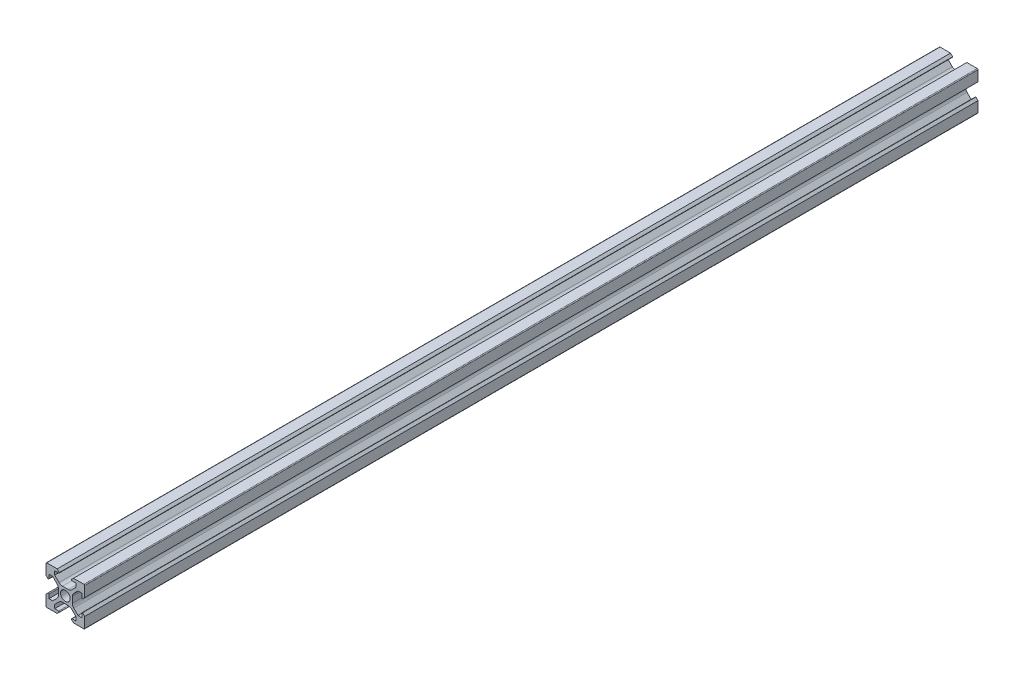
ISO-10303-21;
HEADER;
FILE_DESCRIPTION(('STEP AP214'),'2;1');
FILE_NAME('part.step','',(''),(''),'','','');
FILE_SCHEMA(('AUTOMOTIVE_DESIGN { 1 0 10303 214 1 1 1 1 }'));
ENDSEC;
DATA;
#1=APPLICATION_CONTEXT('core data for automotive mechanical design processes');
#2=APPLICATION_PROTOCOL_DEFINITION('international standard','automotive_design',2000,#1);
#3=PRODUCT_CONTEXT('',#1,'mechanical');
#4=PRODUCT('Part','Part','',(#3));
#5=PRODUCT_RELATED_PRODUCT_CATEGORY('part','',(#4));
#6=PRODUCT_DEFINITION_FORMATION('','',#4);
#7=PRODUCT_DEFINITION_CONTEXT('part definition',#1,'design');
#8=PRODUCT_DEFINITION('design','',#6,#7);
#9=PRODUCT_DEFINITION_SHAPE('','',#8);
#10=(LENGTH_UNIT() NAMED_UNIT(*) SI_UNIT(.MILLI.,.METRE.));
#11=(NAMED_UNIT(*) PLANE_ANGLE_UNIT() SI_UNIT($,.RADIAN.));
#12=(NAMED_UNIT(*) SI_UNIT($,.STERADIAN.) SOLID_ANGLE_UNIT());
#13=UNCERTAINTY_MEASURE_WITH_UNIT(LENGTH_MEASURE(1.E-05),#10,'distance_accuracy_value','');
#14=(GEOMETRIC_REPRESENTATION_CONTEXT(3) GLOBAL_UNCERTAINTY_ASSIGNED_CONTEXT((#13)) GLOBAL_UNIT_ASSIGNED_CONTEXT((#10,
#11,#12)) REPRESENTATION_CONTEXT('',''));
#15=CARTESIAN_POINT('',(0.,0.,0.));
#16=DIRECTION('',(0.,0.,1.));
#17=DIRECTION('',(1.,0.,0.));
#18=AXIS2_PLACEMENT_3D('',#15,#16,#17);
#19=CARTESIAN_POINT('',(-3.49999999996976,8.8999999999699,231.));
#20=DIRECTION('',(0.,0.,-1.));
#21=DIRECTION('',(-1.,0.,0.));
#22=AXIS2_PLACEMENT_3D('',#19,#20,#21);
#23=CYLINDRICAL_SURFACE('',#22,0.4);
#24=CARTESIAN_POINT('',(-3.49999999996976,8.8999999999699,231.));
#25=DIRECTION('',(0.,0.,-1.));
#26=DIRECTION('',(-1.,0.,0.));
#27=AXIS2_PLACEMENT_3D('',#24,#25,#26);
#28=CIRCLE('',#27,0.4);
#29=CARTESIAN_POINT('',(-3.09999999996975,8.89999999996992,231.));
#30=VERTEX_POINT('',#29);
#31=CARTESIAN_POINT('',(-3.4999999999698,8.49999999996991,231.));
#32=VERTEX_POINT('',#31);
#33=EDGE_CURVE('E960',#30,#32,#28,.T.);
#34=ORIENTED_EDGE('',*,*,#33,.T.);
#35=DIRECTION('',(0.,0.,1.));
#36=VECTOR('',#35,1.);
#37=CARTESIAN_POINT('',(-3.49999999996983,8.49999999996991,231.));
#38=LINE('',#37,#36);
#39=CARTESIAN_POINT('',(-3.4999999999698,8.49999999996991,-231.));
#40=VERTEX_POINT('',#39);
#41=EDGE_CURVE('E802',#32,#40,#38,.F.);
#42=ORIENTED_EDGE('',*,*,#41,.T.);
#43=CARTESIAN_POINT('',(-3.49999999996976,8.8999999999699,-231.));
#44=DIRECTION('',(0.,0.,-1.));
#45=DIRECTION('',(-1.,0.,0.));
#46=AXIS2_PLACEMENT_3D('',#43,#44,#45);
#47=CIRCLE('',#46,0.4);
#48=CARTESIAN_POINT('',(-3.09999999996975,8.89999999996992,-231.));
#49=VERTEX_POINT('',#48);
#50=EDGE_CURVE('E20',#40,#49,#47,.F.);
#51=ORIENTED_EDGE('',*,*,#50,.T.);
#52=DIRECTION('',(0.,0.,1.));
#53=VECTOR('',#52,1.);
#54=CARTESIAN_POINT('',(-3.09999999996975,8.89999999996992,231.));
#55=LINE('',#54,#53);
#56=EDGE_CURVE('E931',#49,#30,#55,.T.);
#57=ORIENTED_EDGE('',*,*,#56,.T.);
#58=EDGE_LOOP('',(#34,#42,#51,#57));
#59=FACE_BOUND('',#58,.T.);
#60=ADVANCED_FACE('F17',(#59),#23,.T.);
#61=CARTESIAN_POINT('',(-3.09999999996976,8.89999999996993,231.));
#62=DIRECTION('',(-0.707106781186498,-0.707106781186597,0.));
#63=DIRECTION('',(0.707106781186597,-0.707106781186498,0.));
#64=AXIS2_PLACEMENT_3D('',#61,#62,#63);
#65=PLANE('',#64);
#66=DIRECTION('',(0.,0.,1.));
#67=VECTOR('',#66,1.);
#68=CARTESIAN_POINT('',(-4.2,9.99999999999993,231.));
#69=LINE('',#68,#67);
#70=CARTESIAN_POINT('',(-4.2,9.99999999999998,-231.));
#71=VERTEX_POINT('',#70);
#72=CARTESIAN_POINT('',(-4.2,9.99999999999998,231.));
#73=VERTEX_POINT('',#72);
#74=EDGE_CURVE('E799',#71,#73,#69,.T.);
#75=ORIENTED_EDGE('',*,*,#74,.T.);
#76=DIRECTION('',(0.707106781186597,-0.707106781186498,0.));
#77=VECTOR('',#76,1.);
#78=CARTESIAN_POINT('',(-3.09999999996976,8.89999999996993,231.));
#79=LINE('',#78,#77);
#80=EDGE_CURVE('E926',#30,#73,#79,.F.);
#81=ORIENTED_EDGE('',*,*,#80,.F.);
#82=ORIENTED_EDGE('',*,*,#56,.F.);
#83=DIRECTION('',(0.707106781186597,-0.707106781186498,0.));
#84=VECTOR('',#83,1.);
#85=CARTESIAN_POINT('',(-3.09999999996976,8.89999999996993,-231.));
#86=LINE('',#85,#84);
#87=EDGE_CURVE('E923',#71,#49,#86,.T.);
#88=ORIENTED_EDGE('',*,*,#87,.F.);
#89=EDGE_LOOP('',(#75,#81,#82,#88));
#90=FACE_BOUND('',#89,.T.);
#91=ADVANCED_FACE('F1025',(#90),#65,.F.);
#92=CARTESIAN_POINT('',(-9.6,9.6,231.));
#93=DIRECTION('',(0.,0.,-1.));
#94=DIRECTION('',(-1.,0.,0.));
#95=AXIS2_PLACEMENT_3D('',#92,#93,#94);
#96=CYLINDRICAL_SURFACE('',#95,0.400000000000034);
#97=CARTESIAN_POINT('',(-9.6,9.6,231.));
#98=DIRECTION('',(0.,0.,-1.));
#99=DIRECTION('',(-1.,0.,0.));
#100=AXIS2_PLACEMENT_3D('',#97,#98,#99);
#101=CIRCLE('',#100,0.400000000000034);
#102=CARTESIAN_POINT('',(-10.,9.60000000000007,231.));
#103=VERTEX_POINT('',#102);
#104=CARTESIAN_POINT('',(-9.6,10.,231.));
#105=VERTEX_POINT('',#104);
#106=EDGE_CURVE('E378',#103,#105,#101,.T.);
#107=ORIENTED_EDGE('',*,*,#106,.T.);
#108=DIRECTION('',(0.,0.,1.));
#109=VECTOR('',#108,1.);
#110=CARTESIAN_POINT('',(-9.6,10.,231.));
#111=LINE('',#110,#109);
#112=CARTESIAN_POINT('',(-9.6,10.,-231.));
#113=VERTEX_POINT('',#112);
#114=EDGE_CURVE('E793',#105,#113,#111,.F.);
#115=ORIENTED_EDGE('',*,*,#114,.T.);
#116=CARTESIAN_POINT('',(-9.6,9.6,-231.));
#117=DIRECTION('',(0.,0.,-1.));
#118=DIRECTION('',(-1.,0.,0.));
#119=AXIS2_PLACEMENT_3D('',#116,#117,#118);
#120=CIRCLE('',#119,0.400000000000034);
#121=CARTESIAN_POINT('',(-10.,9.60000000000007,-231.));
#122=VERTEX_POINT('',#121);
#123=EDGE_CURVE('E925',#113,#122,#120,.F.);
#124=ORIENTED_EDGE('',*,*,#123,.T.);
#125=DIRECTION('',(0.,0.,-1.));
#126=VECTOR('',#125,1.);
#127=CARTESIAN_POINT('',(-10.,9.60000000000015,231.));
#128=LINE('',#127,#126);
#129=EDGE_CURVE('E388',#122,#103,#128,.F.);
#130=ORIENTED_EDGE('',*,*,#129,.T.);
#131=EDGE_LOOP('',(#107,#115,#124,#130));
#132=FACE_BOUND('',#131,.T.);
#133=ADVANCED_FACE('F1868',(#132),#96,.T.);
#134=CARTESIAN_POINT('',(-8.89999999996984,3.09999999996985,231.));
#135=DIRECTION('',(0.70710678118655,0.707106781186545,0.));
#136=DIRECTION('',(-0.707106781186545,0.70710678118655,0.));
#137=AXIS2_PLACEMENT_3D('',#134,#135,#136);
#138=PLANE('',#137);
#139=DIRECTION('',(0.,0.,-1.));
#140=VECTOR('',#139,1.);
#141=CARTESIAN_POINT('',(-8.89999999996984,3.09999999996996,231.));
#142=LINE('',#141,#140);
#143=CARTESIAN_POINT('',(-8.89999999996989,3.09999999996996,231.));
#144=VERTEX_POINT('',#143);
#145=CARTESIAN_POINT('',(-8.89999999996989,3.09999999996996,-231.));
#146=VERTEX_POINT('',#145);
#147=EDGE_CURVE('E375',#144,#146,#142,.T.);
#148=ORIENTED_EDGE('',*,*,#147,.F.);
#149=DIRECTION('',(-0.707106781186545,0.70710678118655,0.));
#150=VECTOR('',#149,1.);
#151=CARTESIAN_POINT('',(-8.89999999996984,3.09999999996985,231.));
#152=LINE('',#151,#150);
#153=CARTESIAN_POINT('',(-10.,4.2,231.));
#154=VERTEX_POINT('',#153);
#155=EDGE_CURVE('E369',#154,#144,#152,.F.);
#156=ORIENTED_EDGE('',*,*,#155,.F.);
#157=DIRECTION('',(0.,0.,-1.));
#158=VECTOR('',#157,1.);
#159=CARTESIAN_POINT('',(-10.,4.2,231.));
#160=LINE('',#159,#158);
#161=CARTESIAN_POINT('',(-10.,4.2,-231.));
#162=VERTEX_POINT('',#161);
#163=EDGE_CURVE('E372',#154,#162,#160,.T.);
#164=ORIENTED_EDGE('',*,*,#163,.T.);
#165=DIRECTION('',(-0.707106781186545,0.70710678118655,0.));
#166=VECTOR('',#165,1.);
#167=CARTESIAN_POINT('',(-8.89999999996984,3.09999999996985,-231.));
#168=LINE('',#167,#166);
#169=EDGE_CURVE('E377',#146,#162,#168,.T.);
#170=ORIENTED_EDGE('',*,*,#169,.F.);
#171=EDGE_LOOP('',(#148,#156,#164,#170));
#172=FACE_BOUND('',#171,.T.);
#173=ADVANCED_FACE('F371',(#172),#138,.F.);
#174=CARTESIAN_POINT('',(-8.89999999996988,3.49999999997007,231.));
#175=DIRECTION('',(0.,0.,-1.));
#176=DIRECTION('',(-1.,0.,0.));
#177=AXIS2_PLACEMENT_3D('',#174,#175,#176);
#178=CYLINDRICAL_SURFACE('',#177,0.400000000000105);
#179=CARTESIAN_POINT('',(-8.89999999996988,3.49999999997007,231.));
#180=DIRECTION('',(0.,0.,-1.));
#181=DIRECTION('',(-1.,0.,0.));
#182=AXIS2_PLACEMENT_3D('',#179,#180,#181);
#183=CIRCLE('',#182,0.400000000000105);
#184=CARTESIAN_POINT('',(-8.49999999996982,3.49999999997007,231.));
#185=VERTEX_POINT('',#184);
#186=EDGE_CURVE('E958',#185,#144,#183,.T.);
#187=ORIENTED_EDGE('',*,*,#186,.T.);
#188=ORIENTED_EDGE('',*,*,#147,.T.);
#189=CARTESIAN_POINT('',(-8.89999999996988,3.49999999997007,-231.));
#190=DIRECTION('',(0.,0.,-1.));
#191=DIRECTION('',(-1.,0.,0.));
#192=AXIS2_PLACEMENT_3D('',#189,#190,#191);
#193=CIRCLE('',#192,0.400000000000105);
#194=CARTESIAN_POINT('',(-8.49999999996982,3.49999999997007,-231.));
#195=VERTEX_POINT('',#194);
#196=EDGE_CURVE('E920',#146,#195,#193,.F.);
#197=ORIENTED_EDGE('',*,*,#196,.T.);
#198=DIRECTION('',(0.,0.,1.));
#199=VECTOR('',#198,1.);
#200=CARTESIAN_POINT('',(-8.49999999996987,3.49999999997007,231.));
#201=LINE('',#200,#199);
#202=EDGE_CURVE('E387',#195,#185,#201,.T.);
#203=ORIENTED_EDGE('',*,*,#202,.T.);
#204=EDGE_LOOP('',(#187,#188,#197,#203));
#205=FACE_BOUND('',#204,.T.);
#206=ADVANCED_FACE('F1126',(#205),#178,.T.);
#207=CARTESIAN_POINT('',(-8.89999999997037,-3.49999999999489,231.));
#208=DIRECTION('',(0.,0.,-1.));
#209=DIRECTION('',(-1.,0.,0.));
#210=AXIS2_PLACEMENT_3D('',#207,#208,#209);
#211=CYLINDRICAL_SURFACE('',#210,0.399999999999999);
#212=CARTESIAN_POINT('',(-8.89999999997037,-3.49999999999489,231.));
#213=DIRECTION('',(0.,0.,-1.));
#214=DIRECTION('',(-1.,0.,0.));
#215=AXIS2_PLACEMENT_3D('',#212,#213,#214);
#216=CIRCLE('',#215,0.399999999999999);
#217=CARTESIAN_POINT('',(-8.8999999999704,-3.09999999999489,231.));
#218=VERTEX_POINT('',#217);
#219=CARTESIAN_POINT('',(-8.49999999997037,-3.49999999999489,231.));
#220=VERTEX_POINT('',#219);
#221=EDGE_CURVE('E955',#218,#220,#216,.T.);
#222=ORIENTED_EDGE('',*,*,#221,.T.);
#223=DIRECTION('',(0.,0.,1.));
#224=VECTOR('',#223,1.);
#225=CARTESIAN_POINT('',(-8.49999999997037,-3.49999999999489,231.));
#226=LINE('',#225,#224);
#227=CARTESIAN_POINT('',(-8.49999999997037,-3.49999999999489,-231.));
#228=VERTEX_POINT('',#227);
#229=EDGE_CURVE('E742',#220,#228,#226,.F.);
#230=ORIENTED_EDGE('',*,*,#229,.T.);
#231=CARTESIAN_POINT('',(-8.89999999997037,-3.49999999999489,-231.));
#232=DIRECTION('',(0.,0.,-1.));
#233=DIRECTION('',(-1.,0.,0.));
#234=AXIS2_PLACEMENT_3D('',#231,#232,#233);
#235=CIRCLE('',#234,0.399999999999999);
#236=CARTESIAN_POINT('',(-8.8999999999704,-3.09999999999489,-231.));
#237=VERTEX_POINT('',#236);
#238=EDGE_CURVE('E957',#228,#237,#235,.F.);
#239=ORIENTED_EDGE('',*,*,#238,.T.);
#240=DIRECTION('',(0.,0.,1.));
#241=VECTOR('',#240,1.);
#242=CARTESIAN_POINT('',(-8.8999999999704,-3.09999999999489,231.));
#243=LINE('',#242,#241);
#244=EDGE_CURVE('E914',#237,#218,#243,.T.);
#245=ORIENTED_EDGE('',*,*,#244,.T.);
#246=EDGE_LOOP('',(#222,#230,#239,#245));
#247=FACE_BOUND('',#246,.T.);
#248=ADVANCED_FACE('F1362',(#247),#211,.T.);
#249=CARTESIAN_POINT('',(-8.8999999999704,-3.09999999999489,231.));
#250=DIRECTION('',(0.707106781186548,-0.707106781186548,0.));
#251=DIRECTION('',(0.707106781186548,0.707106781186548,0.));
#252=AXIS2_PLACEMENT_3D('',#249,#250,#251);
#253=PLANE('',#252);
#254=DIRECTION('',(0.,0.,-1.));
#255=VECTOR('',#254,1.);
#256=CARTESIAN_POINT('',(-10.0000000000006,-4.20000000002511,231.));
#257=LINE('',#256,#255);
#258=CARTESIAN_POINT('',(-10.0000000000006,-4.20000000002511,-231.));
#259=VERTEX_POINT('',#258);
#260=CARTESIAN_POINT('',(-10.0000000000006,-4.20000000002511,231.));
#261=VERTEX_POINT('',#260);
#262=EDGE_CURVE('E739',#259,#261,#257,.F.);
#263=ORIENTED_EDGE('',*,*,#262,.T.);
#264=DIRECTION('',(0.707106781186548,0.707106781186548,0.));
#265=VECTOR('',#264,1.);
#266=CARTESIAN_POINT('',(-8.8999999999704,-3.09999999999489,231.));
#267=LINE('',#266,#265);
#268=EDGE_CURVE('E910',#218,#261,#267,.F.);
#269=ORIENTED_EDGE('',*,*,#268,.F.);
#270=ORIENTED_EDGE('',*,*,#244,.F.);
#271=DIRECTION('',(0.707106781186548,0.707106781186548,0.));
#272=VECTOR('',#271,1.);
#273=CARTESIAN_POINT('',(-8.8999999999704,-3.09999999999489,-231.));
#274=LINE('',#273,#272);
#275=EDGE_CURVE('E906',#259,#237,#274,.T.);
#276=ORIENTED_EDGE('',*,*,#275,.F.);
#277=EDGE_LOOP('',(#263,#269,#270,#276));
#278=FACE_BOUND('',#277,.T.);
#279=ADVANCED_FACE('F1356',(#278),#253,.F.);
#280=CARTESIAN_POINT('',(-9.60000000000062,-9.60000000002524,231.));
#281=DIRECTION('',(0.,0.,-1.));
#282=DIRECTION('',(-1.,0.,0.));
#283=AXIS2_PLACEMENT_3D('',#280,#281,#282);
#284=CYLINDRICAL_SURFACE('',#283,0.399999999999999);
#285=CARTESIAN_POINT('',(-9.60000000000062,-9.60000000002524,231.));
#286=DIRECTION('',(0.,0.,-1.));
#287=DIRECTION('',(-1.,0.,0.));
#288=AXIS2_PLACEMENT_3D('',#285,#286,#287);
#289=CIRCLE('',#288,0.399999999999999);
#290=CARTESIAN_POINT('',(-9.60000000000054,-10.0000000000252,231.));
#291=VERTEX_POINT('',#290);
#292=CARTESIAN_POINT('',(-10.0000000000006,-9.60000000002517,231.));
#293=VERTEX_POINT('',#292);
#294=EDGE_CURVE('E899',#291,#293,#289,.T.);
#295=ORIENTED_EDGE('',*,*,#294,.T.);
#296=DIRECTION('',(0.,0.,-1.));
#297=VECTOR('',#296,1.);
#298=CARTESIAN_POINT('',(-10.0000000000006,-9.60000000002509,231.));
#299=LINE('',#298,#297);
#300=CARTESIAN_POINT('',(-10.0000000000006,-9.60000000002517,-231.));
#301=VERTEX_POINT('',#300);
#302=EDGE_CURVE('E732',#293,#301,#299,.T.);
#303=ORIENTED_EDGE('',*,*,#302,.T.);
#304=CARTESIAN_POINT('',(-9.60000000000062,-9.60000000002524,-231.));
#305=DIRECTION('',(0.,0.,-1.));
#306=DIRECTION('',(-1.,0.,0.));
#307=AXIS2_PLACEMENT_3D('',#304,#305,#306);
#308=CIRCLE('',#307,0.399999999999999);
#309=CARTESIAN_POINT('',(-9.60000000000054,-10.0000000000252,-231.));
#310=VERTEX_POINT('',#309);
#311=EDGE_CURVE('E909',#301,#310,#308,.F.);
#312=ORIENTED_EDGE('',*,*,#311,.T.);
#313=DIRECTION('',(0.,0.,1.));
#314=VECTOR('',#313,1.);
#315=CARTESIAN_POINT('',(-9.60000000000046,-10.0000000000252,231.));
#316=LINE('',#315,#314);
#317=EDGE_CURVE('E729',#310,#291,#316,.T.);
#318=ORIENTED_EDGE('',*,*,#317,.T.);
#319=EDGE_LOOP('',(#295,#303,#312,#318));
#320=FACE_BOUND('',#319,.T.);
#321=ADVANCED_FACE('F1349',(#320),#284,.T.);
#322=CARTESIAN_POINT('',(-3.09999999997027,-8.89999999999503,231.));
#323=DIRECTION('',(-0.707106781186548,0.707106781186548,0.));
#324=DIRECTION('',(-0.707106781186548,-0.707106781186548,0.));
#325=AXIS2_PLACEMENT_3D('',#322,#323,#324);
#326=PLANE('',#325);
#327=DIRECTION('',(0.,0.,-1.));
#328=VECTOR('',#327,1.);
#329=CARTESIAN_POINT('',(-3.09999999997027,-8.89999999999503,231.));
#330=LINE('',#329,#328);
#331=CARTESIAN_POINT('',(-3.09999999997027,-8.89999999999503,231.));
#332=VERTEX_POINT('',#331);
#333=CARTESIAN_POINT('',(-3.09999999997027,-8.89999999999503,-231.));
#334=VERTEX_POINT('',#333);
#335=EDGE_CURVE('E948',#332,#334,#330,.T.);
#336=ORIENTED_EDGE('',*,*,#335,.F.);
#337=DIRECTION('',(-0.707106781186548,-0.707106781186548,0.));
#338=VECTOR('',#337,1.);
#339=CARTESIAN_POINT('',(-3.09999999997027,-8.89999999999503,231.));
#340=LINE('',#339,#338);
#341=CARTESIAN_POINT('',(-4.20000000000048,-10.0000000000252,231.));
#342=VERTEX_POINT('',#341);
#343=EDGE_CURVE('E895',#342,#332,#340,.F.);
#344=ORIENTED_EDGE('',*,*,#343,.F.);
#345=DIRECTION('',(0.,0.,1.));
#346=VECTOR('',#345,1.);
#347=CARTESIAN_POINT('',(-4.20000000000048,-10.0000000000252,231.));
#348=LINE('',#347,#346);
#349=CARTESIAN_POINT('',(-4.20000000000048,-10.0000000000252,-231.));
#350=VERTEX_POINT('',#349);
#351=EDGE_CURVE('E728',#342,#350,#348,.F.);
#352=ORIENTED_EDGE('',*,*,#351,.T.);
#353=DIRECTION('',(-0.707106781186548,-0.707106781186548,0.));
#354=VECTOR('',#353,1.);
#355=CARTESIAN_POINT('',(-3.09999999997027,-8.89999999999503,-231.));
#356=LINE('',#355,#354);
#357=EDGE_CURVE('E898',#334,#350,#356,.T.);
#358=ORIENTED_EDGE('',*,*,#357,.F.);
#359=EDGE_LOOP('',(#336,#344,#352,#358));
#360=FACE_BOUND('',#359,.T.);
#361=ADVANCED_FACE('F1340',(#360),#326,.F.);
#362=CARTESIAN_POINT('',(-3.49999999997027,-8.89999999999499,231.));
#363=DIRECTION('',(0.,0.,-1.));
#364=DIRECTION('',(-1.,0.,0.));
#365=AXIS2_PLACEMENT_3D('',#362,#363,#364);
#366=CYLINDRICAL_SURFACE('',#365,0.4);
#367=CARTESIAN_POINT('',(-3.49999999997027,-8.89999999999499,231.));
#368=DIRECTION('',(0.,0.,-1.));
#369=DIRECTION('',(-1.,0.,0.));
#370=AXIS2_PLACEMENT_3D('',#367,#368,#369);
#371=CIRCLE('',#370,0.4);
#372=CARTESIAN_POINT('',(-3.49999999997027,-8.49999999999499,231.));
#373=VERTEX_POINT('',#372);
#374=EDGE_CURVE('E952',#373,#332,#371,.T.);
#375=ORIENTED_EDGE('',*,*,#374,.T.);
#376=ORIENTED_EDGE('',*,*,#335,.T.);
#377=CARTESIAN_POINT('',(-3.49999999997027,-8.89999999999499,-231.));
#378=DIRECTION('',(0.,0.,-1.));
#379=DIRECTION('',(-1.,0.,0.));
#380=AXIS2_PLACEMENT_3D('',#377,#378,#379);
#381=CIRCLE('',#380,0.4);
#382=CARTESIAN_POINT('',(-3.49999999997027,-8.49999999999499,-231.));
#383=VERTEX_POINT('',#382);
#384=EDGE_CURVE('E903',#334,#383,#381,.F.);
#385=ORIENTED_EDGE('',*,*,#384,.T.);
#386=DIRECTION('',(0.,0.,-1.));
#387=VECTOR('',#386,1.);
#388=CARTESIAN_POINT('',(-3.49999999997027,-8.49999999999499,231.));
#389=LINE('',#388,#387);
#390=EDGE_CURVE('E723',#383,#373,#389,.F.);
#391=ORIENTED_EDGE('',*,*,#390,.T.);
#392=EDGE_LOOP('',(#375,#376,#385,#391));
#393=FACE_BOUND('',#392,.T.);
#394=ADVANCED_FACE('F1337',(#393),#366,.T.);
#395=CARTESIAN_POINT('',(3.50000000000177,-8.89999999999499,231.));
#396=DIRECTION('',(0.,0.,-1.));
#397=DIRECTION('',(-1.,0.,0.));
#398=AXIS2_PLACEMENT_3D('',#395,#396,#397);
#399=CYLINDRICAL_SURFACE('',#398,0.4);
#400=CARTESIAN_POINT('',(3.50000000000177,-8.89999999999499,231.));
#401=DIRECTION('',(0.,0.,-1.));
#402=DIRECTION('',(-1.,0.,0.));
#403=AXIS2_PLACEMENT_3D('',#400,#401,#402);
#404=CIRCLE('',#403,0.4);
#405=CARTESIAN_POINT('',(3.10000000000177,-8.89999999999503,231.));
#406=VERTEX_POINT('',#405);
#407=CARTESIAN_POINT('',(3.50000000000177,-8.49999999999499,231.));
#408=VERTEX_POINT('',#407);
#409=EDGE_CURVE('E947',#406,#408,#404,.T.);
#410=ORIENTED_EDGE('',*,*,#409,.T.);
#411=DIRECTION('',(0.,0.,1.));
#412=VECTOR('',#411,1.);
#413=CARTESIAN_POINT('',(3.50000000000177,-8.49999999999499,231.));
#414=LINE('',#413,#412);
#415=CARTESIAN_POINT('',(3.50000000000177,-8.49999999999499,-231.));
#416=VERTEX_POINT('',#415);
#417=EDGE_CURVE('E674',#408,#416,#414,.F.);
#418=ORIENTED_EDGE('',*,*,#417,.T.);
#419=CARTESIAN_POINT('',(3.50000000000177,-8.89999999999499,-231.));
#420=DIRECTION('',(0.,0.,-1.));
#421=DIRECTION('',(-1.,0.,0.));
#422=AXIS2_PLACEMENT_3D('',#419,#420,#421);
#423=CIRCLE('',#422,0.4);
#424=CARTESIAN_POINT('',(3.10000000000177,-8.89999999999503,-231.));
#425=VERTEX_POINT('',#424);
#426=EDGE_CURVE('E951',#416,#425,#423,.F.);
#427=ORIENTED_EDGE('',*,*,#426,.T.);
#428=DIRECTION('',(0.,0.,1.));
#429=VECTOR('',#428,1.);
#430=CARTESIAN_POINT('',(3.10000000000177,-8.89999999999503,231.));
#431=LINE('',#430,#429);
#432=EDGE_CURVE('E892',#425,#406,#431,.T.);
#433=ORIENTED_EDGE('',*,*,#432,.T.);
#434=EDGE_LOOP('',(#410,#418,#427,#433));
#435=FACE_BOUND('',#434,.T.);
#436=ADVANCED_FACE('F1296',(#435),#399,.T.);
#437=CARTESIAN_POINT('',(3.10000000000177,-8.89999999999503,231.));
#438=DIRECTION('',(0.707106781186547,0.707106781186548,0.));
#439=DIRECTION('',(-0.707106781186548,0.707106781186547,0.));
#440=AXIS2_PLACEMENT_3D('',#437,#438,#439);
#441=PLANE('',#440);
#442=DIRECTION('',(0.,0.,1.));
#443=VECTOR('',#442,1.);
#444=CARTESIAN_POINT('',(4.20000000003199,-10.0000000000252,231.));
#445=LINE('',#444,#443);
#446=CARTESIAN_POINT('',(4.20000000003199,-10.0000000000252,-231.));
#447=VERTEX_POINT('',#446);
#448=CARTESIAN_POINT('',(4.20000000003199,-10.0000000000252,231.));
#449=VERTEX_POINT('',#448);
#450=EDGE_CURVE('E671',#447,#449,#445,.T.);
#451=ORIENTED_EDGE('',*,*,#450,.T.);
#452=DIRECTION('',(-0.707106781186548,0.707106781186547,0.));
#453=VECTOR('',#452,1.);
#454=CARTESIAN_POINT('',(3.10000000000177,-8.89999999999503,231.));
#455=LINE('',#454,#453);
#456=EDGE_CURVE('E888',#406,#449,#455,.F.);
#457=ORIENTED_EDGE('',*,*,#456,.F.);
#458=ORIENTED_EDGE('',*,*,#432,.F.);
#459=DIRECTION('',(-0.707106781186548,0.707106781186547,0.));
#460=VECTOR('',#459,1.);
#461=CARTESIAN_POINT('',(3.10000000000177,-8.89999999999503,-231.));
#462=LINE('',#461,#460);
#463=EDGE_CURVE('E884',#447,#425,#462,.T.);
#464=ORIENTED_EDGE('',*,*,#463,.F.);
#465=EDGE_LOOP('',(#451,#457,#458,#464));
#466=FACE_BOUND('',#465,.T.);
#467=ADVANCED_FACE('F1293',(#466),#441,.F.);
#468=CARTESIAN_POINT('',(9.60000000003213,-9.60000000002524,231.));
#469=DIRECTION('',(0.,0.,-1.));
#470=DIRECTION('',(-1.,0.,0.));
#471=AXIS2_PLACEMENT_3D('',#468,#469,#470);
#472=CYLINDRICAL_SURFACE('',#471,0.399999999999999);
#473=CARTESIAN_POINT('',(9.60000000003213,-9.60000000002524,231.));
#474=DIRECTION('',(0.,0.,-1.));
#475=DIRECTION('',(-1.,0.,0.));
#476=AXIS2_PLACEMENT_3D('',#473,#474,#475);
#477=CIRCLE('',#476,0.399999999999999);
#478=CARTESIAN_POINT('',(10.0000000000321,-9.60000000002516,231.));
#479=VERTEX_POINT('',#478);
#480=CARTESIAN_POINT('',(9.60000000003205,-10.0000000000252,231.));
#481=VERTEX_POINT('',#480);
#482=EDGE_CURVE('E877',#479,#481,#477,.T.);
#483=ORIENTED_EDGE('',*,*,#482,.T.);
#484=DIRECTION('',(0.,0.,1.));
#485=VECTOR('',#484,1.);
#486=CARTESIAN_POINT('',(9.60000000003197,-10.0000000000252,231.));
#487=LINE('',#486,#485);
#488=CARTESIAN_POINT('',(9.60000000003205,-10.0000000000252,-231.));
#489=VERTEX_POINT('',#488);
#490=EDGE_CURVE('E664',#481,#489,#487,.F.);
#491=ORIENTED_EDGE('',*,*,#490,.T.);
#492=CARTESIAN_POINT('',(9.60000000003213,-9.60000000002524,-231.));
#493=DIRECTION('',(0.,0.,-1.));
#494=DIRECTION('',(-1.,0.,0.));
#495=AXIS2_PLACEMENT_3D('',#492,#493,#494);
#496=CIRCLE('',#495,0.399999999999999);
#497=CARTESIAN_POINT('',(10.0000000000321,-9.60000000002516,-231.));
#498=VERTEX_POINT('',#497);
#499=EDGE_CURVE('E887',#489,#498,#496,.F.);
#500=ORIENTED_EDGE('',*,*,#499,.T.);
#501=DIRECTION('',(0.,0.,1.));
#502=VECTOR('',#501,1.);
#503=CARTESIAN_POINT('',(10.0000000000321,-9.60000000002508,231.));
#504=LINE('',#503,#502);
#505=EDGE_CURVE('E661',#498,#479,#504,.T.);
#506=ORIENTED_EDGE('',*,*,#505,.T.);
#507=EDGE_LOOP('',(#483,#491,#500,#506));
#508=FACE_BOUND('',#507,.T.);
#509=ADVANCED_FACE('F1284',(#508),#472,.T.);
#510=CARTESIAN_POINT('',(8.9000000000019,-3.09999999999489,231.));
#511=DIRECTION('',(-0.707106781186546,-0.707106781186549,0.));
#512=DIRECTION('',(0.707106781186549,-0.707106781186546,0.));
#513=AXIS2_PLACEMENT_3D('',#510,#511,#512);
#514=PLANE('',#513);
#515=DIRECTION('',(0.,0.,-1.));
#516=VECTOR('',#515,1.);
#517=CARTESIAN_POINT('',(8.9000000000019,-3.09999999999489,231.));
#518=LINE('',#517,#516);
#519=CARTESIAN_POINT('',(8.9000000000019,-3.09999999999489,231.));
#520=VERTEX_POINT('',#519);
#521=CARTESIAN_POINT('',(8.9000000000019,-3.09999999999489,-231.));
#522=VERTEX_POINT('',#521);
#523=EDGE_CURVE('E940',#520,#522,#518,.T.);
#524=ORIENTED_EDGE('',*,*,#523,.F.);
#525=DIRECTION('',(0.707106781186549,-0.707106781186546,0.));
#526=VECTOR('',#525,1.);
#527=CARTESIAN_POINT('',(8.9000000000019,-3.09999999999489,231.));
#528=LINE('',#527,#526);
#529=CARTESIAN_POINT('',(10.0000000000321,-4.2000000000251,231.));
#530=VERTEX_POINT('',#529);
#531=EDGE_CURVE('E873',#530,#520,#528,.F.);
#532=ORIENTED_EDGE('',*,*,#531,.F.);
#533=DIRECTION('',(0.,0.,1.));
#534=VECTOR('',#533,1.);
#535=CARTESIAN_POINT('',(10.0000000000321,-4.2000000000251,231.));
#536=LINE('',#535,#534);
#537=CARTESIAN_POINT('',(10.0000000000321,-4.2000000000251,-231.));
#538=VERTEX_POINT('',#537);
#539=EDGE_CURVE('E660',#530,#538,#536,.F.);
#540=ORIENTED_EDGE('',*,*,#539,.T.);
#541=DIRECTION('',(0.707106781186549,-0.707106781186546,0.));
#542=VECTOR('',#541,1.);
#543=CARTESIAN_POINT('',(8.9000000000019,-3.09999999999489,-231.));
#544=LINE('',#543,#542);
#545=EDGE_CURVE('E876',#522,#538,#544,.T.);
#546=ORIENTED_EDGE('',*,*,#545,.F.);
#547=EDGE_LOOP('',(#524,#532,#540,#546));
#548=FACE_BOUND('',#547,.T.);
#549=ADVANCED_FACE('F1278',(#548),#514,.F.);
#550=CARTESIAN_POINT('',(8.90000000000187,-3.49999999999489,231.));
#551=DIRECTION('',(0.,0.,-1.));
#552=DIRECTION('',(-1.,0.,0.));
#553=AXIS2_PLACEMENT_3D('',#550,#551,#552);
#554=CYLINDRICAL_SURFACE('',#553,0.399999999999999);
#555=CARTESIAN_POINT('',(8.90000000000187,-3.49999999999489,231.));
#556=DIRECTION('',(0.,0.,-1.));
#557=DIRECTION('',(-1.,0.,0.));
#558=AXIS2_PLACEMENT_3D('',#555,#556,#557);
#559=CIRCLE('',#558,0.399999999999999);
#560=CARTESIAN_POINT('',(8.50000000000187,-3.49999999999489,231.));
#561=VERTEX_POINT('',#560);
#562=EDGE_CURVE('E944',#561,#520,#559,.T.);
#563=ORIENTED_EDGE('',*,*,#562,.T.);
#564=ORIENTED_EDGE('',*,*,#523,.T.);
#565=CARTESIAN_POINT('',(8.90000000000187,-3.49999999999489,-231.));
#566=DIRECTION('',(0.,0.,-1.));
#567=DIRECTION('',(-1.,0.,0.));
#568=AXIS2_PLACEMENT_3D('',#565,#566,#567);
#569=CIRCLE('',#568,0.399999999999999);
#570=CARTESIAN_POINT('',(8.50000000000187,-3.49999999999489,-231.));
#571=VERTEX_POINT('',#570);
#572=EDGE_CURVE('E881',#522,#571,#569,.F.);
#573=ORIENTED_EDGE('',*,*,#572,.T.);
#574=DIRECTION('',(0.,0.,-1.));
#575=VECTOR('',#574,1.);
#576=CARTESIAN_POINT('',(8.50000000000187,-3.49999999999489,231.));
#577=LINE('',#576,#575);
#578=EDGE_CURVE('E655',#571,#561,#577,.F.);
#579=ORIENTED_EDGE('',*,*,#578,.T.);
#580=EDGE_LOOP('',(#563,#564,#573,#579));
#581=FACE_BOUND('',#580,.T.);
#582=ADVANCED_FACE('F1273',(#581),#554,.T.);
#583=CARTESIAN_POINT('',(8.90000000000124,3.49999999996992,231.));
#584=DIRECTION('',(0.,0.,-1.));
#585=DIRECTION('',(-1.,0.,0.));
#586=AXIS2_PLACEMENT_3D('',#583,#584,#585);
#587=CYLINDRICAL_SURFACE('',#586,0.399999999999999);
#588=CARTESIAN_POINT('',(8.90000000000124,3.49999999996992,231.));
#589=DIRECTION('',(0.,0.,-1.));
#590=DIRECTION('',(-1.,0.,0.));
#591=AXIS2_PLACEMENT_3D('',#588,#589,#590);
#592=CIRCLE('',#591,0.399999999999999);
#593=CARTESIAN_POINT('',(8.90000000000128,3.09999999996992,231.));
#594=VERTEX_POINT('',#593);
#595=CARTESIAN_POINT('',(8.50000000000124,3.49999999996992,231.));
#596=VERTEX_POINT('',#595);
#597=EDGE_CURVE('E939',#594,#596,#592,.T.);
#598=ORIENTED_EDGE('',*,*,#597,.T.);
#599=DIRECTION('',(0.,0.,-1.));
#600=VECTOR('',#599,1.);
#601=CARTESIAN_POINT('',(8.50000000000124,3.49999999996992,231.));
#602=LINE('',#601,#600);
#603=CARTESIAN_POINT('',(8.50000000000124,3.49999999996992,-231.));
#604=VERTEX_POINT('',#603);
#605=EDGE_CURVE('E606',#596,#604,#602,.T.);
#606=ORIENTED_EDGE('',*,*,#605,.T.);
#607=CARTESIAN_POINT('',(8.90000000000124,3.49999999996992,-231.));
#608=DIRECTION('',(0.,0.,-1.));
#609=DIRECTION('',(-1.,0.,0.));
#610=AXIS2_PLACEMENT_3D('',#607,#608,#609);
#611=CIRCLE('',#610,0.399999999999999);
#612=CARTESIAN_POINT('',(8.90000000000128,3.09999999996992,-231.));
#613=VERTEX_POINT('',#612);
#614=EDGE_CURVE('E943',#604,#613,#611,.F.);
#615=ORIENTED_EDGE('',*,*,#614,.T.);
#616=DIRECTION('',(0.,0.,1.));
#617=VECTOR('',#616,1.);
#618=CARTESIAN_POINT('',(8.90000000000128,3.09999999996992,231.));
#619=LINE('',#618,#617);
#620=EDGE_CURVE('E870',#613,#594,#619,.T.);
#621=ORIENTED_EDGE('',*,*,#620,.T.);
#622=EDGE_LOOP('',(#598,#606,#615,#621));
#623=FACE_BOUND('',#622,.T.);
#624=ADVANCED_FACE('F1235',(#623),#587,.T.);
#625=CARTESIAN_POINT('',(8.90000000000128,3.09999999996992,231.));
#626=DIRECTION('',(-0.707106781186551,0.707106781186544,0.));
#627=DIRECTION('',(-0.707106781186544,-0.707106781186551,0.));
#628=AXIS2_PLACEMENT_3D('',#625,#626,#627);
#629=PLANE('',#628);
#630=DIRECTION('',(0.,0.,1.));
#631=VECTOR('',#630,1.);
#632=CARTESIAN_POINT('',(10.0000000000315,4.20000000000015,231.));
#633=LINE('',#632,#631);
#634=CARTESIAN_POINT('',(10.0000000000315,4.20000000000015,-231.));
#635=VERTEX_POINT('',#634);
#636=CARTESIAN_POINT('',(10.0000000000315,4.20000000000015,231.));
#637=VERTEX_POINT('',#636);
#638=EDGE_CURVE('E603',#635,#637,#633,.T.);
#639=ORIENTED_EDGE('',*,*,#638,.T.);
#640=DIRECTION('',(-0.707106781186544,-0.707106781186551,0.));
#641=VECTOR('',#640,1.);
#642=CARTESIAN_POINT('',(8.90000000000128,3.09999999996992,231.));
#643=LINE('',#642,#641);
#644=EDGE_CURVE('E866',#594,#637,#643,.F.);
#645=ORIENTED_EDGE('',*,*,#644,.F.);
#646=ORIENTED_EDGE('',*,*,#620,.F.);
#647=DIRECTION('',(-0.707106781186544,-0.707106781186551,0.));
#648=VECTOR('',#647,1.);
#649=CARTESIAN_POINT('',(8.90000000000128,3.09999999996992,-231.));
#650=LINE('',#649,#648);
#651=EDGE_CURVE('E862',#635,#613,#650,.T.);
#652=ORIENTED_EDGE('',*,*,#651,.F.);
#653=EDGE_LOOP('',(#639,#645,#646,#652));
#654=FACE_BOUND('',#653,.T.);
#655=ADVANCED_FACE('F1229',(#654),#629,.F.);
#656=CARTESIAN_POINT('',(9.60000000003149,9.60000000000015,231.));
#657=DIRECTION('',(0.,0.,-1.));
#658=DIRECTION('',(-1.,0.,0.));
#659=AXIS2_PLACEMENT_3D('',#656,#657,#658);
#660=CYLINDRICAL_SURFACE('',#659,0.399999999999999);
#661=CARTESIAN_POINT('',(9.60000000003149,9.60000000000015,231.));
#662=DIRECTION('',(0.,0.,-1.));
#663=DIRECTION('',(-1.,0.,0.));
#664=AXIS2_PLACEMENT_3D('',#661,#662,#663);
#665=CIRCLE('',#664,0.399999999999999);
#666=CARTESIAN_POINT('',(9.60000000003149,10.0000000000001,231.));
#667=VERTEX_POINT('',#666);
#668=CARTESIAN_POINT('',(10.0000000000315,9.60000000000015,231.));
#669=VERTEX_POINT('',#668);
#670=EDGE_CURVE('E855',#667,#669,#665,.T.);
#671=ORIENTED_EDGE('',*,*,#670,.T.);
#672=DIRECTION('',(0.,0.,1.));
#673=VECTOR('',#672,1.);
#674=CARTESIAN_POINT('',(10.0000000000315,9.60000000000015,231.));
#675=LINE('',#674,#673);
#676=CARTESIAN_POINT('',(10.0000000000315,9.60000000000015,-231.));
#677=VERTEX_POINT('',#676);
#678=EDGE_CURVE('E596',#669,#677,#675,.F.);
#679=ORIENTED_EDGE('',*,*,#678,.T.);
#680=CARTESIAN_POINT('',(9.60000000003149,9.60000000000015,-231.));
#681=DIRECTION('',(0.,0.,-1.));
#682=DIRECTION('',(-1.,0.,0.));
#683=AXIS2_PLACEMENT_3D('',#680,#681,#682);
#684=CIRCLE('',#683,0.399999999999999);
#685=CARTESIAN_POINT('',(9.60000000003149,10.0000000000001,-231.));
#686=VERTEX_POINT('',#685);
#687=EDGE_CURVE('E865',#677,#686,#684,.F.);
#688=ORIENTED_EDGE('',*,*,#687,.T.);
#689=DIRECTION('',(0.,0.,1.));
#690=VECTOR('',#689,1.);
#691=CARTESIAN_POINT('',(9.60000000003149,10.0000000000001,231.));
#692=LINE('',#691,#690);
#693=EDGE_CURVE('E593',#686,#667,#692,.T.);
#694=ORIENTED_EDGE('',*,*,#693,.T.);
#695=EDGE_LOOP('',(#671,#679,#688,#694));
#696=FACE_BOUND('',#695,.T.);
#697=ADVANCED_FACE('F1222',(#696),#660,.T.);
#698=CARTESIAN_POINT('',(3.10000000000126,8.89999999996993,231.));
#699=DIRECTION('',(0.707106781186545,-0.70710678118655,0.));
#700=DIRECTION('',(0.70710678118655,0.707106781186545,0.));
#701=AXIS2_PLACEMENT_3D('',#698,#699,#700);
#702=PLANE('',#701);
#703=DIRECTION('',(0.,0.,-1.));
#704=VECTOR('',#703,1.);
#705=CARTESIAN_POINT('',(3.10000000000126,8.8999999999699,231.));
#706=LINE('',#705,#704);
#707=CARTESIAN_POINT('',(3.10000000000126,8.89999999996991,231.));
#708=VERTEX_POINT('',#707);
#709=CARTESIAN_POINT('',(3.10000000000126,8.89999999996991,-231.));
#710=VERTEX_POINT('',#709);
#711=EDGE_CURVE('E816',#708,#710,#706,.T.);
#712=ORIENTED_EDGE('',*,*,#711,.F.);
#713=DIRECTION('',(0.70710678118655,0.707106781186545,0.));
#714=VECTOR('',#713,1.);
#715=CARTESIAN_POINT('',(3.10000000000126,8.89999999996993,231.));
#716=LINE('',#715,#714);
#717=CARTESIAN_POINT('',(4.20000000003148,10.0000000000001,231.));
#718=VERTEX_POINT('',#717);
#719=EDGE_CURVE('E851',#718,#708,#716,.F.);
#720=ORIENTED_EDGE('',*,*,#719,.F.);
#721=DIRECTION('',(0.,0.,1.));
#722=VECTOR('',#721,1.);
#723=CARTESIAN_POINT('',(4.20000000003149,10.0000000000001,231.));
#724=LINE('',#723,#722);
#725=CARTESIAN_POINT('',(4.20000000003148,10.0000000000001,-231.));
#726=VERTEX_POINT('',#725);
#727=EDGE_CURVE('E592',#718,#726,#724,.F.);
#728=ORIENTED_EDGE('',*,*,#727,.T.);
#729=DIRECTION('',(0.70710678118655,0.707106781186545,0.));
#730=VECTOR('',#729,1.);
#731=CARTESIAN_POINT('',(3.10000000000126,8.89999999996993,-231.));
#732=LINE('',#731,#730);
#733=EDGE_CURVE('E854',#710,#726,#732,.T.);
#734=ORIENTED_EDGE('',*,*,#733,.F.);
#735=EDGE_LOOP('',(#712,#720,#728,#734));
#736=FACE_BOUND('',#735,.T.);
#737=ADVANCED_FACE('F1215',(#736),#702,.F.);
#738=CARTESIAN_POINT('',(3.50000000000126,8.8999999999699,231.));
#739=DIRECTION('',(0.,0.,-1.));
#740=DIRECTION('',(-1.,0.,0.));
#741=AXIS2_PLACEMENT_3D('',#738,#739,#740);
#742=CYLINDRICAL_SURFACE('',#741,0.4);
#743=CARTESIAN_POINT('',(3.50000000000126,8.8999999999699,231.));
#744=DIRECTION('',(0.,0.,-1.));
#745=DIRECTION('',(-1.,0.,0.));
#746=AXIS2_PLACEMENT_3D('',#743,#744,#745);
#747=CIRCLE('',#746,0.4);
#748=CARTESIAN_POINT('',(3.50000000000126,8.4999999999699,231.));
#749=VERTEX_POINT('',#748);
#750=EDGE_CURVE('E936',#749,#708,#747,.T.);
#751=ORIENTED_EDGE('',*,*,#750,.T.);
#752=ORIENTED_EDGE('',*,*,#711,.T.);
#753=CARTESIAN_POINT('',(3.50000000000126,8.8999999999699,-231.));
#754=DIRECTION('',(0.,0.,-1.));
#755=DIRECTION('',(-1.,0.,0.));
#756=AXIS2_PLACEMENT_3D('',#753,#754,#755);
#757=CIRCLE('',#756,0.4);
#758=CARTESIAN_POINT('',(3.50000000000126,8.4999999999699,-231.));
#759=VERTEX_POINT('',#758);
#760=EDGE_CURVE('E859',#710,#759,#757,.F.);
#761=ORIENTED_EDGE('',*,*,#760,.T.);
#762=DIRECTION('',(0.,0.,1.));
#763=VECTOR('',#762,1.);
#764=CARTESIAN_POINT('',(3.50000000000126,8.4999999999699,231.));
#765=LINE('',#764,#763);
#766=EDGE_CURVE('E587',#759,#749,#765,.T.);
#767=ORIENTED_EDGE('',*,*,#766,.T.);
#768=EDGE_LOOP('',(#751,#752,#761,#767));
#769=FACE_BOUND('',#768,.T.);
#770=ADVANCED_FACE('F1218',(#769),#742,.T.);
#771=CARTESIAN_POINT('',(-5.49999999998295,6.56066017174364,231.));
#772=DIRECTION('',(-0.707106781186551,-0.707106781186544,0.));
#773=DIRECTION('',(0.707106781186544,-0.707106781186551,0.));
#774=AXIS2_PLACEMENT_3D('',#771,#772,#773);
#775=PLANE('',#774);
#776=DIRECTION('',(0.,0.,1.));
#777=VECTOR('',#776,1.);
#778=CARTESIAN_POINT('',(-5.49999999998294,6.56066017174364,231.));
#779=LINE('',#778,#777);
#780=CARTESIAN_POINT('',(-5.49999999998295,6.56066017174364,-231.));
#781=VERTEX_POINT('',#780);
#782=CARTESIAN_POINT('',(-5.49999999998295,6.56066017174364,231.));
#783=VERTEX_POINT('',#782);
#784=EDGE_CURVE('E807',#781,#783,#779,.T.);
#785=ORIENTED_EDGE('',*,*,#784,.T.);
#786=DIRECTION('',(-0.707106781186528,0.707106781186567,0.));
#787=VECTOR('',#786,1.);
#788=CARTESIAN_POINT('',(-3.27157287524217,4.33223304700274,231.));
#789=LINE('',#788,#787);
#790=CARTESIAN_POINT('',(-3.27157287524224,4.33223304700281,231.));
#791=VERTEX_POINT('',#790);
#792=EDGE_CURVE('E413',#791,#783,#789,.T.);
#793=ORIENTED_EDGE('',*,*,#792,.F.);
#794=DIRECTION('',(0.,0.,-1.));
#795=VECTOR('',#794,1.);
#796=CARTESIAN_POINT('',(-3.27157287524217,4.33223304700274,231.));
#797=LINE('',#796,#795);
#798=CARTESIAN_POINT('',(-3.27157287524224,4.33223304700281,-231.));
#799=VERTEX_POINT('',#798);
#800=EDGE_CURVE('E564',#791,#799,#797,.T.);
#801=ORIENTED_EDGE('',*,*,#800,.T.);
#802=DIRECTION('',(-0.707106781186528,0.707106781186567,0.));
#803=VECTOR('',#802,1.);
#804=CARTESIAN_POINT('',(-3.27157287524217,4.33223304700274,-231.));
#805=LINE('',#804,#803);
#806=EDGE_CURVE('E415',#799,#781,#805,.T.);
#807=ORIENTED_EDGE('',*,*,#806,.T.);
#808=EDGE_LOOP('',(#785,#793,#801,#807));
#809=FACE_BOUND('',#808,.T.);
#810=ADVANCED_FACE('F1042',(#809),#775,.F.);
#811=CARTESIAN_POINT('',(-5.49999999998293,8.49999999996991,231.));
#812=DIRECTION('',(-1.,0.,0.));
#813=DIRECTION('',(0.,-1.,0.));
#814=AXIS2_PLACEMENT_3D('',#811,#812,#813);
#815=PLANE('',#814);
#816=DIRECTION('',(0.,0.,1.));
#817=VECTOR('',#816,1.);
#818=CARTESIAN_POINT('',(-5.49999999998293,8.49999999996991,231.));
#819=LINE('',#818,#817);
#820=CARTESIAN_POINT('',(-5.49999999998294,8.49999999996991,-231.));
#821=VERTEX_POINT('',#820);
#822=CARTESIAN_POINT('',(-5.49999999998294,8.49999999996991,231.));
#823=VERTEX_POINT('',#822);
#824=EDGE_CURVE('E330',#821,#823,#819,.T.);
#825=ORIENTED_EDGE('',*,*,#824,.T.);
#826=DIRECTION('',(0.,1.,0.));
#827=VECTOR('',#826,1.);
#828=CARTESIAN_POINT('',(-5.49999999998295,6.09999999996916,231.));
#829=LINE('',#828,#827);
#830=EDGE_CURVE('E410',#783,#823,#829,.T.);
#831=ORIENTED_EDGE('',*,*,#830,.F.);
#832=ORIENTED_EDGE('',*,*,#784,.F.);
#833=DIRECTION('',(0.,1.,0.));
#834=VECTOR('',#833,1.);
#835=CARTESIAN_POINT('',(-5.49999999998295,6.09999999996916,-231.));
#836=LINE('',#835,#834);
#837=EDGE_CURVE('E559',#781,#821,#836,.T.);
#838=ORIENTED_EDGE('',*,*,#837,.T.);
#839=EDGE_LOOP('',(#825,#831,#832,#838));
#840=FACE_BOUND('',#839,.T.);
#841=ADVANCED_FACE('F1039',(#840),#815,.F.);
#842=CARTESIAN_POINT('',(-5.49999999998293,8.49999999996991,231.));
#843=DIRECTION('',(0.,1.,0.));
#844=DIRECTION('',(0.,0.,1.));
#845=AXIS2_PLACEMENT_3D('',#842,#843,#844);
#846=PLANE('',#845);
#847=ORIENTED_EDGE('',*,*,#41,.F.);
#848=DIRECTION('',(1.,0.,0.));
#849=VECTOR('',#848,1.);
#850=CARTESIAN_POINT('',(-1.50380592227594,8.49999999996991,231.));
#851=LINE('',#850,#849);
#852=EDGE_CURVE('E399',#823,#32,#851,.T.);
#853=ORIENTED_EDGE('',*,*,#852,.F.);
#854=ORIENTED_EDGE('',*,*,#824,.F.);
#855=DIRECTION('',(1.,0.,0.));
#856=VECTOR('',#855,1.);
#857=CARTESIAN_POINT('',(-1.50380592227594,8.49999999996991,-231.));
#858=LINE('',#857,#856);
#859=EDGE_CURVE('E555',#821,#40,#858,.T.);
#860=ORIENTED_EDGE('',*,*,#859,.T.);
#861=EDGE_LOOP('',(#847,#853,#854,#860));
#862=FACE_BOUND('',#861,.T.);
#863=ADVANCED_FACE('F1035',(#862),#846,.F.);
#864=CARTESIAN_POINT('',(-9.6,10.,231.));
#865=DIRECTION('',(0.,-1.,0.));
#866=DIRECTION('',(1.,0.,0.));
#867=AXIS2_PLACEMENT_3D('',#864,#865,#866);
#868=PLANE('',#867);
#869=ORIENTED_EDGE('',*,*,#114,.F.);
#870=DIRECTION('',(1.,0.,0.));
#871=VECTOR('',#870,1.);
#872=CARTESIAN_POINT('',(-1.50380592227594,10.,231.));
#873=LINE('',#872,#871);
#874=EDGE_CURVE('E394',#73,#105,#873,.F.);
#875=ORIENTED_EDGE('',*,*,#874,.F.);
#876=ORIENTED_EDGE('',*,*,#74,.F.);
#877=DIRECTION('',(1.,0.,0.));
#878=VECTOR('',#877,1.);
#879=CARTESIAN_POINT('',(-1.50380592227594,10.,-231.));
#880=LINE('',#879,#878);
#881=EDGE_CURVE('E550',#71,#113,#880,.F.);
#882=ORIENTED_EDGE('',*,*,#881,.T.);
#883=EDGE_LOOP('',(#869,#875,#876,#882));
#884=FACE_BOUND('',#883,.T.);
#885=ADVANCED_FACE('F1032',(#884),#868,.F.);
#886=CARTESIAN_POINT('',(-10.,9.60000000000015,231.));
#887=DIRECTION('',(1.,0.,0.));
#888=DIRECTION('',(0.,0.,-1.));
#889=AXIS2_PLACEMENT_3D('',#886,#887,#888);
#890=PLANE('',#889);
#891=ORIENTED_EDGE('',*,*,#163,.F.);
#892=DIRECTION('',(0.,1.,0.));
#893=VECTOR('',#892,1.);
#894=CARTESIAN_POINT('',(-10.,6.09999999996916,231.));
#895=LINE('',#894,#893);
#896=EDGE_CURVE('E384',#103,#154,#895,.F.);
#897=ORIENTED_EDGE('',*,*,#896,.F.);
#898=ORIENTED_EDGE('',*,*,#129,.F.);
#899=DIRECTION('',(0.,1.,0.));
#900=VECTOR('',#899,1.);
#901=CARTESIAN_POINT('',(-10.,6.09999999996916,-231.));
#902=LINE('',#901,#900);
#903=EDGE_CURVE('E386',#122,#162,#902,.F.);
#904=ORIENTED_EDGE('',*,*,#903,.T.);
#905=EDGE_LOOP('',(#891,#897,#898,#904));
#906=FACE_BOUND('',#905,.T.);
#907=ADVANCED_FACE('F382',(#906),#890,.F.);
#908=CARTESIAN_POINT('',(-8.49999999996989,5.49999999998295,231.));
#909=DIRECTION('',(-1.,0.,0.));
#910=DIRECTION('',(0.,-1.,0.));
#911=AXIS2_PLACEMENT_3D('',#908,#909,#910);
#912=PLANE('',#911);
#913=DIRECTION('',(0.,0.,1.));
#914=VECTOR('',#913,1.);
#915=CARTESIAN_POINT('',(-8.49999999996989,5.49999999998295,231.));
#916=LINE('',#915,#914);
#917=CARTESIAN_POINT('',(-8.49999999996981,5.49999999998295,-231.));
#918=VERTEX_POINT('',#917);
#919=CARTESIAN_POINT('',(-8.49999999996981,5.49999999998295,231.));
#920=VERTEX_POINT('',#919);
#921=EDGE_CURVE('E779',#918,#920,#916,.T.);
#922=ORIENTED_EDGE('',*,*,#921,.T.);
#923=DIRECTION('',(0.,1.,0.));
#924=VECTOR('',#923,1.);
#925=CARTESIAN_POINT('',(-8.49999999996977,6.09999999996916,231.));
#926=LINE('',#925,#924);
#927=EDGE_CURVE('E393',#185,#920,#926,.T.);
#928=ORIENTED_EDGE('',*,*,#927,.F.);
#929=ORIENTED_EDGE('',*,*,#202,.F.);
#930=DIRECTION('',(0.,1.,0.));
#931=VECTOR('',#930,1.);
#932=CARTESIAN_POINT('',(-8.49999999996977,6.09999999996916,-231.));
#933=LINE('',#932,#931);
#934=EDGE_CURVE('E544',#195,#918,#933,.T.);
#935=ORIENTED_EDGE('',*,*,#934,.T.);
#936=EDGE_LOOP('',(#922,#928,#929,#935));
#937=FACE_BOUND('',#936,.T.);
#938=ADVANCED_FACE('F1124',(#937),#912,.F.);
#939=CARTESIAN_POINT('',(-8.49999999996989,5.49999999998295,231.));
#940=DIRECTION('',(0.,1.,0.));
#941=DIRECTION('',(0.,0.,1.));
#942=AXIS2_PLACEMENT_3D('',#939,#940,#941);
#943=PLANE('',#942);
#944=DIRECTION('',(0.,0.,1.));
#945=VECTOR('',#944,1.);
#946=CARTESIAN_POINT('',(-6.56066017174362,5.49999999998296,231.));
#947=LINE('',#946,#945);
#948=CARTESIAN_POINT('',(-6.56066017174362,5.49999999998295,-231.));
#949=VERTEX_POINT('',#948);
#950=CARTESIAN_POINT('',(-6.56066017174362,5.49999999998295,231.));
#951=VERTEX_POINT('',#950);
#952=EDGE_CURVE('E776',#949,#951,#947,.T.);
#953=ORIENTED_EDGE('',*,*,#952,.T.);
#954=DIRECTION('',(1.,0.,0.));
#955=VECTOR('',#954,1.);
#956=CARTESIAN_POINT('',(-1.50380592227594,5.49999999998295,231.));
#957=LINE('',#956,#955);
#958=EDGE_CURVE('E397',#920,#951,#957,.T.);
#959=ORIENTED_EDGE('',*,*,#958,.F.);
#960=ORIENTED_EDGE('',*,*,#921,.F.);
#961=DIRECTION('',(1.,0.,0.));
#962=VECTOR('',#961,1.);
#963=CARTESIAN_POINT('',(-1.50380592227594,5.49999999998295,-231.));
#964=LINE('',#963,#962);
#965=EDGE_CURVE('E541',#918,#949,#964,.T.);
#966=ORIENTED_EDGE('',*,*,#965,.T.);
#967=EDGE_LOOP('',(#953,#959,#960,#966));
#968=FACE_BOUND('',#967,.T.);
#969=ADVANCED_FACE('F1116',(#968),#943,.F.);
#970=CARTESIAN_POINT('',(-6.56066017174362,5.49999999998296,231.));
#971=DIRECTION('',(0.707106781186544,0.707106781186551,0.));
#972=DIRECTION('',(-0.707106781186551,0.707106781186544,0.));
#973=AXIS2_PLACEMENT_3D('',#970,#971,#972);
#974=PLANE('',#973);
#975=DIRECTION('',(0.,0.,-1.));
#976=VECTOR('',#975,1.);
#977=CARTESIAN_POINT('',(-4.33223304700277,3.27157287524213,231.));
#978=LINE('',#977,#976);
#979=CARTESIAN_POINT('',(-4.33223304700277,3.27157287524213,-231.));
#980=VERTEX_POINT('',#979);
#981=CARTESIAN_POINT('',(-4.33223304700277,3.27157287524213,231.));
#982=VERTEX_POINT('',#981);
#983=EDGE_CURVE('E773',#980,#982,#978,.F.);
#984=ORIENTED_EDGE('',*,*,#983,.T.);
#985=DIRECTION('',(0.707106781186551,-0.707106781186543,0.));
#986=VECTOR('',#985,1.);
#987=CARTESIAN_POINT('',(-6.56066017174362,5.49999999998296,231.));
#988=LINE('',#987,#986);
#989=EDGE_CURVE('E784',#951,#982,#988,.T.);
#990=ORIENTED_EDGE('',*,*,#989,.F.);
#991=ORIENTED_EDGE('',*,*,#952,.F.);
#992=DIRECTION('',(0.707106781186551,-0.707106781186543,0.));
#993=VECTOR('',#992,1.);
#994=CARTESIAN_POINT('',(-6.56066017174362,5.49999999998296,-231.));
#995=LINE('',#994,#993);
#996=EDGE_CURVE('E538',#949,#980,#995,.T.);
#997=ORIENTED_EDGE('',*,*,#996,.T.);
#998=EDGE_LOOP('',(#984,#990,#991,#997));
#999=FACE_BOUND('',#998,.T.);
#1000=ADVANCED_FACE('F1129',(#999),#974,.F.);
#1001=CARTESIAN_POINT('',(-6.09999999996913,1.50380592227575,231.));
#1002=DIRECTION('',(0.,0.,-1.));
#1003=DIRECTION('',(-1.,0.,0.));
#1004=AXIS2_PLACEMENT_3D('',#1001,#1002,#1003);
#1005=CYLINDRICAL_SURFACE('',#1004,2.5);
#1006=DIRECTION('',(0.,0.,-1.));
#1007=VECTOR('',#1006,1.);
#1008=CARTESIAN_POINT('',(-3.5999999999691,1.50380592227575,231.));
#1009=LINE('',#1008,#1007);
#1010=CARTESIAN_POINT('',(-3.59999999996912,1.50380592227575,-231.));
#1011=VERTEX_POINT('',#1010);
#1012=CARTESIAN_POINT('',(-3.59999999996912,1.50380592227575,231.));
#1013=VERTEX_POINT('',#1012);
#1014=EDGE_CURVE('E770',#1011,#1013,#1009,.F.);
#1015=ORIENTED_EDGE('',*,*,#1014,.T.);
#1016=CARTESIAN_POINT('',(-6.09999999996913,1.50380592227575,231.));
#1017=DIRECTION('',(0.,0.,-1.));
#1018=DIRECTION('',(-1.,0.,0.));
#1019=AXIS2_PLACEMENT_3D('',#1016,#1017,#1018);
#1020=CIRCLE('',#1019,2.5);
#1021=EDGE_CURVE('E981',#982,#1013,#1020,.T.);
#1022=ORIENTED_EDGE('',*,*,#1021,.F.);
#1023=ORIENTED_EDGE('',*,*,#983,.F.);
#1024=CARTESIAN_POINT('',(-6.09999999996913,1.50380592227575,-231.));
#1025=DIRECTION('',(0.,0.,-1.));
#1026=DIRECTION('',(-1.,0.,0.));
#1027=AXIS2_PLACEMENT_3D('',#1024,#1025,#1026);
#1028=CIRCLE('',#1027,2.5);
#1029=EDGE_CURVE('E537',#980,#1011,#1028,.T.);
#1030=ORIENTED_EDGE('',*,*,#1029,.T.);
#1031=EDGE_LOOP('',(#1015,#1022,#1023,#1030));
#1032=FACE_BOUND('',#1031,.T.);
#1033=ADVANCED_FACE('F1382',(#1032),#1005,.F.);
#1034=CARTESIAN_POINT('',(-3.5999999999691,-1.50380592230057,231.));
#1035=DIRECTION('',(1.,0.,0.));
#1036=DIRECTION('',(0.,0.,-1.));
#1037=AXIS2_PLACEMENT_3D('',#1034,#1035,#1036);
#1038=PLANE('',#1037);
#1039=DIRECTION('',(0.,0.,-1.));
#1040=VECTOR('',#1039,1.);
#1041=CARTESIAN_POINT('',(-3.59999999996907,-1.50380592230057,231.));
#1042=LINE('',#1041,#1040);
#1043=CARTESIAN_POINT('',(-3.5999999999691,-1.50380592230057,-231.));
#1044=VERTEX_POINT('',#1043);
#1045=CARTESIAN_POINT('',(-3.5999999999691,-1.50380592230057,231.));
#1046=VERTEX_POINT('',#1045);
#1047=EDGE_CURVE('E767',#1044,#1046,#1042,.F.);
#1048=ORIENTED_EDGE('',*,*,#1047,.T.);
#1049=DIRECTION('',(0.,1.,0.));
#1050=VECTOR('',#1049,1.);
#1051=CARTESIAN_POINT('',(-3.59999999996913,6.09999999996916,231.));
#1052=LINE('',#1051,#1050);
#1053=EDGE_CURVE('E980',#1013,#1046,#1052,.F.);
#1054=ORIENTED_EDGE('',*,*,#1053,.F.);
#1055=ORIENTED_EDGE('',*,*,#1014,.F.);
#1056=DIRECTION('',(0.,1.,0.));
#1057=VECTOR('',#1056,1.);
#1058=CARTESIAN_POINT('',(-3.59999999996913,6.09999999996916,-231.));
#1059=LINE('',#1058,#1057);
#1060=EDGE_CURVE('E534',#1011,#1044,#1059,.F.);
#1061=ORIENTED_EDGE('',*,*,#1060,.T.);
#1062=EDGE_LOOP('',(#1048,#1054,#1055,#1061));
#1063=FACE_BOUND('',#1062,.T.);
#1064=ADVANCED_FACE('F1379',(#1063),#1038,.F.);
#1065=CARTESIAN_POINT('',(-6.09999999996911,-1.50380592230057,231.));
#1066=DIRECTION('',(0.,0.,-1.));
#1067=DIRECTION('',(-1.,0.,0.));
#1068=AXIS2_PLACEMENT_3D('',#1065,#1066,#1067);
#1069=CYLINDRICAL_SURFACE('',#1068,2.50000000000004);
#1070=DIRECTION('',(0.,0.,1.));
#1071=VECTOR('',#1070,1.);
#1072=CARTESIAN_POINT('',(-4.33223304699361,-3.27157287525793,231.));
#1073=LINE('',#1072,#1071);
#1074=CARTESIAN_POINT('',(-4.33223304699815,-3.27157287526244,-231.));
#1075=VERTEX_POINT('',#1074);
#1076=CARTESIAN_POINT('',(-4.33223304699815,-3.27157287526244,231.));
#1077=VERTEX_POINT('',#1076);
#1078=EDGE_CURVE('E762',#1075,#1077,#1073,.T.);
#1079=ORIENTED_EDGE('',*,*,#1078,.T.);
#1080=CARTESIAN_POINT('',(-6.09999999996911,-1.50380592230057,231.));
#1081=DIRECTION('',(0.,0.,-1.));
#1082=DIRECTION('',(-1.,0.,0.));
#1083=AXIS2_PLACEMENT_3D('',#1080,#1081,#1082);
#1084=CIRCLE('',#1083,2.50000000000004);
#1085=EDGE_CURVE('E978',#1046,#1077,#1084,.T.);
#1086=ORIENTED_EDGE('',*,*,#1085,.F.);
#1087=ORIENTED_EDGE('',*,*,#1047,.F.);
#1088=CARTESIAN_POINT('',(-6.09999999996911,-1.50380592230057,-231.));
#1089=DIRECTION('',(0.,0.,-1.));
#1090=DIRECTION('',(-1.,0.,0.));
#1091=AXIS2_PLACEMENT_3D('',#1088,#1089,#1090);
#1092=CIRCLE('',#1091,2.50000000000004);
#1093=EDGE_CURVE('E531',#1044,#1075,#1092,.T.);
#1094=ORIENTED_EDGE('',*,*,#1093,.T.);
#1095=EDGE_LOOP('',(#1079,#1086,#1087,#1094));
#1096=FACE_BOUND('',#1095,.T.);
#1097=ADVANCED_FACE('F1376',(#1096),#1069,.F.);
#1098=CARTESIAN_POINT('',(-6.56066017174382,-5.50000000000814,231.));
#1099=DIRECTION('',(0.707106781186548,-0.707106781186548,0.));
#1100=DIRECTION('',(0.707106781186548,0.707106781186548,0.));
#1101=AXIS2_PLACEMENT_3D('',#1098,#1099,#1100);
#1102=PLANE('',#1101);
#1103=DIRECTION('',(0.,0.,-1.));
#1104=VECTOR('',#1103,1.);
#1105=CARTESIAN_POINT('',(-6.56066017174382,-5.50000000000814,231.));
#1106=LINE('',#1105,#1104);
#1107=CARTESIAN_POINT('',(-6.56066017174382,-5.50000000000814,-231.));
#1108=VERTEX_POINT('',#1107);
#1109=CARTESIAN_POINT('',(-6.56066017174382,-5.50000000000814,231.));
#1110=VERTEX_POINT('',#1109);
#1111=EDGE_CURVE('E750',#1108,#1110,#1106,.F.);
#1112=ORIENTED_EDGE('',*,*,#1111,.T.);
#1113=DIRECTION('',(-0.707106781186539,-0.707106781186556,0.));
#1114=VECTOR('',#1113,1.);
#1115=CARTESIAN_POINT('',(-4.33223304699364,-3.27157287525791,231.));
#1116=LINE('',#1115,#1114);
#1117=EDGE_CURVE('E757',#1077,#1110,#1116,.T.);
#1118=ORIENTED_EDGE('',*,*,#1117,.F.);
#1119=ORIENTED_EDGE('',*,*,#1078,.F.);
#1120=DIRECTION('',(-0.707106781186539,-0.707106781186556,0.));
#1121=VECTOR('',#1120,1.);
#1122=CARTESIAN_POINT('',(-4.33223304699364,-3.27157287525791,-231.));
#1123=LINE('',#1122,#1121);
#1124=EDGE_CURVE('E528',#1075,#1108,#1123,.T.);
#1125=ORIENTED_EDGE('',*,*,#1124,.T.);
#1126=EDGE_LOOP('',(#1112,#1118,#1119,#1125));
#1127=FACE_BOUND('',#1126,.T.);
#1128=ADVANCED_FACE('F1372',(#1127),#1102,.F.);
#1129=CARTESIAN_POINT('',(-8.49999999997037,-5.50000000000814,231.));
#1130=DIRECTION('',(0.,-1.,0.));
#1131=DIRECTION('',(0.,0.,-1.));
#1132=AXIS2_PLACEMENT_3D('',#1129,#1130,#1131);
#1133=PLANE('',#1132);
#1134=DIRECTION('',(0.,0.,1.));
#1135=VECTOR('',#1134,1.);
#1136=CARTESIAN_POINT('',(-8.49999999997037,-5.50000000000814,231.));
#1137=LINE('',#1136,#1135);
#1138=CARTESIAN_POINT('',(-8.49999999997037,-5.50000000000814,-231.));
#1139=VERTEX_POINT('',#1138);
#1140=CARTESIAN_POINT('',(-8.49999999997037,-5.50000000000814,231.));
#1141=VERTEX_POINT('',#1140);
#1142=EDGE_CURVE('E747',#1139,#1141,#1137,.T.);
#1143=ORIENTED_EDGE('',*,*,#1142,.T.);
#1144=DIRECTION('',(1.,0.,0.));
#1145=VECTOR('',#1144,1.);
#1146=CARTESIAN_POINT('',(-1.50380592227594,-5.50000000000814,231.));
#1147=LINE('',#1146,#1145);
#1148=EDGE_CURVE('E753',#1110,#1141,#1147,.F.);
#1149=ORIENTED_EDGE('',*,*,#1148,.F.);
#1150=ORIENTED_EDGE('',*,*,#1111,.F.);
#1151=DIRECTION('',(1.,0.,0.));
#1152=VECTOR('',#1151,1.);
#1153=CARTESIAN_POINT('',(-1.50380592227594,-5.50000000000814,-231.));
#1154=LINE('',#1153,#1152);
#1155=EDGE_CURVE('E525',#1108,#1139,#1154,.F.);
#1156=ORIENTED_EDGE('',*,*,#1155,.T.);
#1157=EDGE_LOOP('',(#1143,#1149,#1150,#1156));
#1158=FACE_BOUND('',#1157,.T.);
#1159=ADVANCED_FACE('F1368',(#1158),#1133,.F.);
#1160=CARTESIAN_POINT('',(-8.49999999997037,-5.50000000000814,231.));
#1161=DIRECTION('',(-1.,0.,0.));
#1162=DIRECTION('',(0.,0.,1.));
#1163=AXIS2_PLACEMENT_3D('',#1160,#1161,#1162);
#1164=PLANE('',#1163);
#1165=ORIENTED_EDGE('',*,*,#229,.F.);
#1166=DIRECTION('',(0.,1.,0.));
#1167=VECTOR('',#1166,1.);
#1168=CARTESIAN_POINT('',(-8.49999999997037,6.09999999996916,231.));
#1169=LINE('',#1168,#1167);
#1170=EDGE_CURVE('E756',#1141,#220,#1169,.T.);
#1171=ORIENTED_EDGE('',*,*,#1170,.F.);
#1172=ORIENTED_EDGE('',*,*,#1142,.F.);
#1173=DIRECTION('',(0.,1.,0.));
#1174=VECTOR('',#1173,1.);
#1175=CARTESIAN_POINT('',(-8.49999999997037,6.09999999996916,-231.));
#1176=LINE('',#1175,#1174);
#1177=EDGE_CURVE('E520',#1139,#228,#1176,.T.);
#1178=ORIENTED_EDGE('',*,*,#1177,.T.);
#1179=EDGE_LOOP('',(#1165,#1171,#1172,#1178));
#1180=FACE_BOUND('',#1179,.T.);
#1181=ADVANCED_FACE('F1365',(#1180),#1164,.F.);
#1182=CARTESIAN_POINT('',(-10.0000000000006,-9.60000000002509,231.));
#1183=DIRECTION('',(1.,0.,0.));
#1184=DIRECTION('',(0.,0.,-1.));
#1185=AXIS2_PLACEMENT_3D('',#1182,#1183,#1184);
#1186=PLANE('',#1185);
#1187=ORIENTED_EDGE('',*,*,#302,.F.);
#1188=DIRECTION('',(0.,1.,0.));
#1189=VECTOR('',#1188,1.);
#1190=CARTESIAN_POINT('',(-10.0000000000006,6.09999999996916,231.));
#1191=LINE('',#1190,#1189);
#1192=EDGE_CURVE('E1143',#261,#293,#1191,.F.);
#1193=ORIENTED_EDGE('',*,*,#1192,.F.);
#1194=ORIENTED_EDGE('',*,*,#262,.F.);
#1195=DIRECTION('',(0.,1.,0.));
#1196=VECTOR('',#1195,1.);
#1197=CARTESIAN_POINT('',(-10.0000000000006,6.09999999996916,-231.));
#1198=LINE('',#1197,#1196);
#1199=EDGE_CURVE('E515',#259,#301,#1198,.F.);
#1200=ORIENTED_EDGE('',*,*,#1199,.T.);
#1201=EDGE_LOOP('',(#1187,#1193,#1194,#1200));
#1202=FACE_BOUND('',#1201,.T.);
#1203=ADVANCED_FACE('F1353',(#1202),#1186,.F.);
#1204=CARTESIAN_POINT('',(-9.60000000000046,-10.0000000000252,231.));
#1205=DIRECTION('',(0.,1.,0.));
#1206=DIRECTION('',(0.,0.,1.));
#1207=AXIS2_PLACEMENT_3D('',#1204,#1205,#1206);
#1208=PLANE('',#1207);
#1209=ORIENTED_EDGE('',*,*,#351,.F.);
#1210=DIRECTION('',(1.,0.,0.));
#1211=VECTOR('',#1210,1.);
#1212=CARTESIAN_POINT('',(-1.50380592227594,-10.0000000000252,231.));
#1213=LINE('',#1212,#1211);
#1214=EDGE_CURVE('E1148',#291,#342,#1213,.T.);
#1215=ORIENTED_EDGE('',*,*,#1214,.F.);
#1216=ORIENTED_EDGE('',*,*,#317,.F.);
#1217=DIRECTION('',(1.,0.,0.));
#1218=VECTOR('',#1217,1.);
#1219=CARTESIAN_POINT('',(-1.50380592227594,-10.0000000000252,-231.));
#1220=LINE('',#1219,#1218);
#1221=EDGE_CURVE('E510',#310,#350,#1220,.T.);
#1222=ORIENTED_EDGE('',*,*,#1221,.T.);
#1223=EDGE_LOOP('',(#1209,#1215,#1216,#1222));
#1224=FACE_BOUND('',#1223,.T.);
#1225=ADVANCED_FACE('F1345',(#1224),#1208,.F.);
#1226=CARTESIAN_POINT('',(-5.49999999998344,-8.49999999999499,231.));
#1227=DIRECTION('',(0.,-1.,0.));
#1228=DIRECTION('',(0.,0.,-1.));
#1229=AXIS2_PLACEMENT_3D('',#1226,#1227,#1228);
#1230=PLANE('',#1229);
#1231=DIRECTION('',(0.,0.,1.));
#1232=VECTOR('',#1231,1.);
#1233=CARTESIAN_POINT('',(-5.49999999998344,-8.49999999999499,231.));
#1234=LINE('',#1233,#1232);
#1235=CARTESIAN_POINT('',(-5.49999999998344,-8.49999999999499,-231.));
#1236=VERTEX_POINT('',#1235);
#1237=CARTESIAN_POINT('',(-5.49999999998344,-8.49999999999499,231.));
#1238=VERTEX_POINT('',#1237);
#1239=EDGE_CURVE('E711',#1236,#1238,#1234,.T.);
#1240=ORIENTED_EDGE('',*,*,#1239,.T.);
#1241=DIRECTION('',(1.,0.,0.));
#1242=VECTOR('',#1241,1.);
#1243=CARTESIAN_POINT('',(-1.50380592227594,-8.49999999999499,231.));
#1244=LINE('',#1243,#1242);
#1245=EDGE_CURVE('E718',#373,#1238,#1244,.F.);
#1246=ORIENTED_EDGE('',*,*,#1245,.F.);
#1247=ORIENTED_EDGE('',*,*,#390,.F.);
#1248=DIRECTION('',(1.,0.,0.));
#1249=VECTOR('',#1248,1.);
#1250=CARTESIAN_POINT('',(-1.50380592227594,-8.49999999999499,-231.));
#1251=LINE('',#1250,#1249);
#1252=EDGE_CURVE('E507',#383,#1236,#1251,.F.);
#1253=ORIENTED_EDGE('',*,*,#1252,.T.);
#1254=EDGE_LOOP('',(#1240,#1246,#1247,#1253));
#1255=FACE_BOUND('',#1254,.T.);
#1256=ADVANCED_FACE('F1332',(#1255),#1230,.F.);
#1257=CARTESIAN_POINT('',(-5.49999999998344,-8.49999999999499,231.));
#1258=DIRECTION('',(-1.,0.,0.));
#1259=DIRECTION('',(0.,0.,1.));
#1260=AXIS2_PLACEMENT_3D('',#1257,#1258,#1259);
#1261=PLANE('',#1260);
#1262=DIRECTION('',(0.,0.,1.));
#1263=VECTOR('',#1262,1.);
#1264=CARTESIAN_POINT('',(-5.49999999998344,-6.56066017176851,231.));
#1265=LINE('',#1264,#1263);
#1266=CARTESIAN_POINT('',(-5.49999999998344,-6.56066017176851,-231.));
#1267=VERTEX_POINT('',#1266);
#1268=CARTESIAN_POINT('',(-5.49999999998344,-6.56066017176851,231.));
#1269=VERTEX_POINT('',#1268);
#1270=EDGE_CURVE('E708',#1267,#1269,#1265,.T.);
#1271=ORIENTED_EDGE('',*,*,#1270,.T.);
#1272=DIRECTION('',(0.,1.,0.));
#1273=VECTOR('',#1272,1.);
#1274=CARTESIAN_POINT('',(-5.49999999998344,6.09999999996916,231.));
#1275=LINE('',#1274,#1273);
#1276=EDGE_CURVE('E714',#1238,#1269,#1275,.T.);
#1277=ORIENTED_EDGE('',*,*,#1276,.F.);
#1278=ORIENTED_EDGE('',*,*,#1239,.F.);
#1279=DIRECTION('',(0.,1.,0.));
#1280=VECTOR('',#1279,1.);
#1281=CARTESIAN_POINT('',(-5.49999999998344,6.09999999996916,-231.));
#1282=LINE('',#1281,#1280);
#1283=EDGE_CURVE('E504',#1236,#1267,#1282,.T.);
#1284=ORIENTED_EDGE('',*,*,#1283,.T.);
#1285=EDGE_LOOP('',(#1271,#1277,#1278,#1284));
#1286=FACE_BOUND('',#1285,.T.);
#1287=ADVANCED_FACE('F1328',(#1286),#1261,.F.);
#1288=CARTESIAN_POINT('',(-5.49999999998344,-6.56066017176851,231.));
#1289=DIRECTION('',(-0.707106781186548,0.707106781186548,0.));
#1290=DIRECTION('',(-0.707106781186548,-0.707106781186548,0.));
#1291=AXIS2_PLACEMENT_3D('',#1288,#1289,#1290);
#1292=PLANE('',#1291);
#1293=DIRECTION('',(0.,0.,-1.));
#1294=VECTOR('',#1293,1.);
#1295=CARTESIAN_POINT('',(-3.27157287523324,-4.33223304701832,231.));
#1296=LINE('',#1295,#1294);
#1297=CARTESIAN_POINT('',(-3.27157287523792,-4.33223304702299,-231.));
#1298=VERTEX_POINT('',#1297);
#1299=CARTESIAN_POINT('',(-3.27157287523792,-4.33223304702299,231.));
#1300=VERTEX_POINT('',#1299);
#1301=EDGE_CURVE('E705',#1298,#1300,#1296,.F.);
#1302=ORIENTED_EDGE('',*,*,#1301,.T.);
#1303=DIRECTION('',(0.707106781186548,0.707106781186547,0.));
#1304=VECTOR('',#1303,1.);
#1305=CARTESIAN_POINT('',(-5.49999999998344,-6.56066017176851,231.));
#1306=LINE('',#1305,#1304);
#1307=EDGE_CURVE('E717',#1269,#1300,#1306,.T.);
#1308=ORIENTED_EDGE('',*,*,#1307,.F.);
#1309=ORIENTED_EDGE('',*,*,#1270,.F.);
#1310=DIRECTION('',(0.707106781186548,0.707106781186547,0.));
#1311=VECTOR('',#1310,1.);
#1312=CARTESIAN_POINT('',(-5.49999999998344,-6.56066017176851,-231.));
#1313=LINE('',#1312,#1311);
#1314=EDGE_CURVE('E501',#1267,#1298,#1313,.T.);
#1315=ORIENTED_EDGE('',*,*,#1314,.T.);
#1316=EDGE_LOOP('',(#1302,#1308,#1309,#1315));
#1317=FACE_BOUND('',#1316,.T.);
#1318=ADVANCED_FACE('F1324',(#1317),#1292,.F.);
#1319=CARTESIAN_POINT('',(-1.50380592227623,-6.09999999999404,231.));
#1320=DIRECTION('',(0.,0.,-1.));
#1321=DIRECTION('',(-1.,0.,0.));
#1322=AXIS2_PLACEMENT_3D('',#1319,#1320,#1321);
#1323=CYLINDRICAL_SURFACE('',#1322,2.5);
#1324=DIRECTION('',(0.,0.,1.));
#1325=VECTOR('',#1324,1.);
#1326=CARTESIAN_POINT('',(-1.50380592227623,-3.59999999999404,231.));
#1327=LINE('',#1326,#1325);
#1328=CARTESIAN_POINT('',(-1.50380592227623,-3.59999999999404,-231.));
#1329=VERTEX_POINT('',#1328);
#1330=CARTESIAN_POINT('',(-1.50380592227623,-3.59999999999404,231.));
#1331=VERTEX_POINT('',#1330);
#1332=EDGE_CURVE('E702',#1329,#1331,#1327,.T.);
#1333=ORIENTED_EDGE('',*,*,#1332,.T.);
#1334=CARTESIAN_POINT('',(-1.50380592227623,-6.09999999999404,231.));
#1335=DIRECTION('',(0.,0.,-1.));
#1336=DIRECTION('',(-1.,0.,0.));
#1337=AXIS2_PLACEMENT_3D('',#1334,#1335,#1336);
#1338=CIRCLE('',#1337,2.5);
#1339=EDGE_CURVE('E976',#1300,#1331,#1338,.T.);
#1340=ORIENTED_EDGE('',*,*,#1339,.F.);
#1341=ORIENTED_EDGE('',*,*,#1301,.F.);
#1342=CARTESIAN_POINT('',(-1.50380592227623,-6.09999999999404,-231.));
#1343=DIRECTION('',(0.,0.,-1.));
#1344=DIRECTION('',(-1.,0.,0.));
#1345=AXIS2_PLACEMENT_3D('',#1342,#1343,#1344);
#1346=CIRCLE('',#1345,2.5);
#1347=EDGE_CURVE('E500',#1298,#1329,#1346,.T.);
#1348=ORIENTED_EDGE('',*,*,#1347,.T.);
#1349=EDGE_LOOP('',(#1333,#1340,#1341,#1348));
#1350=FACE_BOUND('',#1349,.T.);
#1351=ADVANCED_FACE('F1320',(#1350),#1323,.F.);
#1352=CARTESIAN_POINT('',(-1.50380592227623,-3.59999999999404,231.));
#1353=DIRECTION('',(0.,1.,0.));
#1354=DIRECTION('',(0.,0.,1.));
#1355=AXIS2_PLACEMENT_3D('',#1352,#1353,#1354);
#1356=PLANE('',#1355);
#1357=DIRECTION('',(0.,0.,-1.));
#1358=VECTOR('',#1357,1.);
#1359=CARTESIAN_POINT('',(1.50380592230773,-3.59999999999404,231.));
#1360=LINE('',#1359,#1358);
#1361=CARTESIAN_POINT('',(1.50380592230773,-3.59999999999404,-231.));
#1362=VERTEX_POINT('',#1361);
#1363=CARTESIAN_POINT('',(1.50380592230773,-3.59999999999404,231.));
#1364=VERTEX_POINT('',#1363);
#1365=EDGE_CURVE('E699',#1362,#1364,#1360,.F.);
#1366=ORIENTED_EDGE('',*,*,#1365,.T.);
#1367=DIRECTION('',(1.,0.,0.));
#1368=VECTOR('',#1367,1.);
#1369=CARTESIAN_POINT('',(-1.50380592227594,-3.59999999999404,231.));
#1370=LINE('',#1369,#1368);
#1371=EDGE_CURVE('E975',#1331,#1364,#1370,.T.);
#1372=ORIENTED_EDGE('',*,*,#1371,.F.);
#1373=ORIENTED_EDGE('',*,*,#1332,.F.);
#1374=DIRECTION('',(1.,0.,0.));
#1375=VECTOR('',#1374,1.);
#1376=CARTESIAN_POINT('',(-1.50380592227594,-3.59999999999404,-231.));
#1377=LINE('',#1376,#1375);
#1378=EDGE_CURVE('E497',#1329,#1362,#1377,.T.);
#1379=ORIENTED_EDGE('',*,*,#1378,.T.);
#1380=EDGE_LOOP('',(#1366,#1372,#1373,#1379));
#1381=FACE_BOUND('',#1380,.T.);
#1382=ADVANCED_FACE('F1316',(#1381),#1356,.F.);
#1383=CARTESIAN_POINT('',(1.50380592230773,-6.09999999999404,231.));
#1384=DIRECTION('',(0.,0.,-1.));
#1385=DIRECTION('',(-1.,0.,0.));
#1386=AXIS2_PLACEMENT_3D('',#1383,#1384,#1385);
#1387=CYLINDRICAL_SURFACE('',#1386,2.5);
#1388=DIRECTION('',(0.,0.,1.));
#1389=VECTOR('',#1388,1.);
#1390=CARTESIAN_POINT('',(3.27157287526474,-4.33223304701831,231.));
#1391=LINE('',#1390,#1389);
#1392=CARTESIAN_POINT('',(3.27157287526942,-4.33223304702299,-231.));
#1393=VERTEX_POINT('',#1392);
#1394=CARTESIAN_POINT('',(3.27157287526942,-4.33223304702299,231.));
#1395=VERTEX_POINT('',#1394);
#1396=EDGE_CURVE('E694',#1393,#1395,#1391,.T.);
#1397=ORIENTED_EDGE('',*,*,#1396,.T.);
#1398=CARTESIAN_POINT('',(1.50380592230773,-6.09999999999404,231.));
#1399=DIRECTION('',(0.,0.,-1.));
#1400=DIRECTION('',(-1.,0.,0.));
#1401=AXIS2_PLACEMENT_3D('',#1398,#1399,#1400);
#1402=CIRCLE('',#1401,2.5);
#1403=EDGE_CURVE('E973',#1364,#1395,#1402,.T.);
#1404=ORIENTED_EDGE('',*,*,#1403,.F.);
#1405=ORIENTED_EDGE('',*,*,#1365,.F.);
#1406=CARTESIAN_POINT('',(1.50380592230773,-6.09999999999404,-231.));
#1407=DIRECTION('',(0.,0.,-1.));
#1408=DIRECTION('',(-1.,0.,0.));
#1409=AXIS2_PLACEMENT_3D('',#1406,#1407,#1408);
#1410=CIRCLE('',#1409,2.5);
#1411=EDGE_CURVE('E494',#1362,#1393,#1410,.T.);
#1412=ORIENTED_EDGE('',*,*,#1411,.T.);
#1413=EDGE_LOOP('',(#1397,#1404,#1405,#1412));
#1414=FACE_BOUND('',#1413,.T.);
#1415=ADVANCED_FACE('F1312',(#1414),#1387,.F.);
#1416=CARTESIAN_POINT('',(5.50000000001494,-6.56066017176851,231.));
#1417=DIRECTION('',(0.707106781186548,0.707106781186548,0.));
#1418=DIRECTION('',(-0.707106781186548,0.707106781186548,0.));
#1419=AXIS2_PLACEMENT_3D('',#1416,#1417,#1418);
#1420=PLANE('',#1419);
#1421=DIRECTION('',(0.,0.,-1.));
#1422=VECTOR('',#1421,1.);
#1423=CARTESIAN_POINT('',(5.50000000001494,-6.56066017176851,231.));
#1424=LINE('',#1423,#1422);
#1425=CARTESIAN_POINT('',(5.50000000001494,-6.56066017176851,-231.));
#1426=VERTEX_POINT('',#1425);
#1427=CARTESIAN_POINT('',(5.50000000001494,-6.56066017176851,231.));
#1428=VERTEX_POINT('',#1427);
#1429=EDGE_CURVE('E682',#1426,#1428,#1424,.F.);
#1430=ORIENTED_EDGE('',*,*,#1429,.T.);
#1431=DIRECTION('',(0.707106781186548,-0.707106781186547,0.));
#1432=VECTOR('',#1431,1.);
#1433=CARTESIAN_POINT('',(3.27157287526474,-4.33223304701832,231.));
#1434=LINE('',#1433,#1432);
#1435=EDGE_CURVE('E689',#1395,#1428,#1434,.T.);
#1436=ORIENTED_EDGE('',*,*,#1435,.F.);
#1437=ORIENTED_EDGE('',*,*,#1396,.F.);
#1438=DIRECTION('',(0.707106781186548,-0.707106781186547,0.));
#1439=VECTOR('',#1438,1.);
#1440=CARTESIAN_POINT('',(3.27157287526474,-4.33223304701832,-231.));
#1441=LINE('',#1440,#1439);
#1442=EDGE_CURVE('E491',#1393,#1426,#1441,.T.);
#1443=ORIENTED_EDGE('',*,*,#1442,.T.);
#1444=EDGE_LOOP('',(#1430,#1436,#1437,#1443));
#1445=FACE_BOUND('',#1444,.T.);
#1446=ADVANCED_FACE('F1308',(#1445),#1420,.F.);
#1447=CARTESIAN_POINT('',(5.50000000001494,-8.49999999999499,231.));
#1448=DIRECTION('',(1.,0.,0.));
#1449=DIRECTION('',(0.,0.,-1.));
#1450=AXIS2_PLACEMENT_3D('',#1447,#1448,#1449);
#1451=PLANE('',#1450);
#1452=DIRECTION('',(0.,0.,1.));
#1453=VECTOR('',#1452,1.);
#1454=CARTESIAN_POINT('',(5.50000000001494,-8.49999999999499,231.));
#1455=LINE('',#1454,#1453);
#1456=CARTESIAN_POINT('',(5.50000000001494,-8.49999999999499,-231.));
#1457=VERTEX_POINT('',#1456);
#1458=CARTESIAN_POINT('',(5.50000000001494,-8.49999999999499,231.));
#1459=VERTEX_POINT('',#1458);
#1460=EDGE_CURVE('E679',#1457,#1459,#1455,.T.);
#1461=ORIENTED_EDGE('',*,*,#1460,.T.);
#1462=DIRECTION('',(0.,1.,0.));
#1463=VECTOR('',#1462,1.);
#1464=CARTESIAN_POINT('',(5.50000000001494,6.09999999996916,231.));
#1465=LINE('',#1464,#1463);
#1466=EDGE_CURVE('E685',#1428,#1459,#1465,.F.);
#1467=ORIENTED_EDGE('',*,*,#1466,.F.);
#1468=ORIENTED_EDGE('',*,*,#1429,.F.);
#1469=DIRECTION('',(0.,1.,0.));
#1470=VECTOR('',#1469,1.);
#1471=CARTESIAN_POINT('',(5.50000000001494,6.09999999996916,-231.));
#1472=LINE('',#1471,#1470);
#1473=EDGE_CURVE('E488',#1426,#1457,#1472,.F.);
#1474=ORIENTED_EDGE('',*,*,#1473,.T.);
#1475=EDGE_LOOP('',(#1461,#1467,#1468,#1474));
#1476=FACE_BOUND('',#1475,.T.);
#1477=ADVANCED_FACE('F1303',(#1476),#1451,.F.);
#1478=CARTESIAN_POINT('',(5.50000000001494,-8.49999999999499,231.));
#1479=DIRECTION('',(0.,-1.,0.));
#1480=DIRECTION('',(1.,0.,0.));
#1481=AXIS2_PLACEMENT_3D('',#1478,#1479,#1480);
#1482=PLANE('',#1481);
#1483=ORIENTED_EDGE('',*,*,#417,.F.);
#1484=DIRECTION('',(1.,0.,0.));
#1485=VECTOR('',#1484,1.);
#1486=CARTESIAN_POINT('',(-1.50380592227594,-8.49999999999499,231.));
#1487=LINE('',#1486,#1485);
#1488=EDGE_CURVE('E688',#1459,#408,#1487,.F.);
#1489=ORIENTED_EDGE('',*,*,#1488,.F.);
#1490=ORIENTED_EDGE('',*,*,#1460,.F.);
#1491=DIRECTION('',(1.,0.,0.));
#1492=VECTOR('',#1491,1.);
#1493=CARTESIAN_POINT('',(-1.50380592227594,-8.49999999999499,-231.));
#1494=LINE('',#1493,#1492);
#1495=EDGE_CURVE('E483',#1457,#416,#1494,.F.);
#1496=ORIENTED_EDGE('',*,*,#1495,.T.);
#1497=EDGE_LOOP('',(#1483,#1489,#1490,#1496));
#1498=FACE_BOUND('',#1497,.T.);
#1499=ADVANCED_FACE('F1383',(#1498),#1482,.F.);
#1500=CARTESIAN_POINT('',(9.60000000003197,-10.0000000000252,231.));
#1501=DIRECTION('',(0.,1.,0.));
#1502=DIRECTION('',(0.,0.,1.));
#1503=AXIS2_PLACEMENT_3D('',#1500,#1501,#1502);
#1504=PLANE('',#1503);
#1505=ORIENTED_EDGE('',*,*,#490,.F.);
#1506=DIRECTION('',(1.,0.,0.));
#1507=VECTOR('',#1506,1.);
#1508=CARTESIAN_POINT('',(-1.50380592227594,-10.0000000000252,231.));
#1509=LINE('',#1508,#1507);
#1510=EDGE_CURVE('E1167',#449,#481,#1509,.T.);
#1511=ORIENTED_EDGE('',*,*,#1510,.F.);
#1512=ORIENTED_EDGE('',*,*,#450,.F.);
#1513=DIRECTION('',(1.,0.,0.));
#1514=VECTOR('',#1513,1.);
#1515=CARTESIAN_POINT('',(-1.50380592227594,-10.0000000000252,-231.));
#1516=LINE('',#1515,#1514);
#1517=EDGE_CURVE('E478',#447,#489,#1516,.T.);
#1518=ORIENTED_EDGE('',*,*,#1517,.T.);
#1519=EDGE_LOOP('',(#1505,#1511,#1512,#1518));
#1520=FACE_BOUND('',#1519,.T.);
#1521=ADVANCED_FACE('F1289',(#1520),#1504,.F.);
#1522=CARTESIAN_POINT('',(10.0000000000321,-9.60000000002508,231.));
#1523=DIRECTION('',(-1.,0.,0.));
#1524=DIRECTION('',(0.,0.,1.));
#1525=AXIS2_PLACEMENT_3D('',#1522,#1523,#1524);
#1526=PLANE('',#1525);
#1527=ORIENTED_EDGE('',*,*,#539,.F.);
#1528=DIRECTION('',(0.,1.,0.));
#1529=VECTOR('',#1528,1.);
#1530=CARTESIAN_POINT('',(10.0000000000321,6.09999999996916,231.));
#1531=LINE('',#1530,#1529);
#1532=EDGE_CURVE('E1172',#479,#530,#1531,.T.);
#1533=ORIENTED_EDGE('',*,*,#1532,.F.);
#1534=ORIENTED_EDGE('',*,*,#505,.F.);
#1535=DIRECTION('',(0.,1.,0.));
#1536=VECTOR('',#1535,1.);
#1537=CARTESIAN_POINT('',(10.0000000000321,6.09999999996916,-231.));
#1538=LINE('',#1537,#1536);
#1539=EDGE_CURVE('E473',#498,#538,#1538,.T.);
#1540=ORIENTED_EDGE('',*,*,#1539,.T.);
#1541=EDGE_LOOP('',(#1527,#1533,#1534,#1540));
#1542=FACE_BOUND('',#1541,.T.);
#1543=ADVANCED_FACE('F1282',(#1542),#1526,.F.);
#1544=CARTESIAN_POINT('',(8.50000000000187,-5.50000000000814,231.));
#1545=DIRECTION('',(1.,0.,0.));
#1546=DIRECTION('',(0.,0.,-1.));
#1547=AXIS2_PLACEMENT_3D('',#1544,#1545,#1546);
#1548=PLANE('',#1547);
#1549=DIRECTION('',(0.,0.,-1.));
#1550=VECTOR('',#1549,1.);
#1551=CARTESIAN_POINT('',(8.50000000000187,-5.50000000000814,231.));
#1552=LINE('',#1551,#1550);
#1553=CARTESIAN_POINT('',(8.50000000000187,-5.50000000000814,-231.));
#1554=VERTEX_POINT('',#1553);
#1555=CARTESIAN_POINT('',(8.50000000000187,-5.50000000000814,231.));
#1556=VERTEX_POINT('',#1555);
#1557=EDGE_CURVE('E643',#1554,#1556,#1552,.F.);
#1558=ORIENTED_EDGE('',*,*,#1557,.T.);
#1559=DIRECTION('',(0.,1.,0.));
#1560=VECTOR('',#1559,1.);
#1561=CARTESIAN_POINT('',(8.50000000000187,6.09999999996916,231.));
#1562=LINE('',#1561,#1560);
#1563=EDGE_CURVE('E650',#561,#1556,#1562,.F.);
#1564=ORIENTED_EDGE('',*,*,#1563,.F.);
#1565=ORIENTED_EDGE('',*,*,#578,.F.);
#1566=DIRECTION('',(0.,1.,0.));
#1567=VECTOR('',#1566,1.);
#1568=CARTESIAN_POINT('',(8.50000000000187,6.09999999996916,-231.));
#1569=LINE('',#1568,#1567);
#1570=EDGE_CURVE('E470',#571,#1554,#1569,.F.);
#1571=ORIENTED_EDGE('',*,*,#1570,.T.);
#1572=EDGE_LOOP('',(#1558,#1564,#1565,#1571));
#1573=FACE_BOUND('',#1572,.T.);
#1574=ADVANCED_FACE('F1270',(#1573),#1548,.F.);
#1575=CARTESIAN_POINT('',(8.50000000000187,-5.50000000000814,231.));
#1576=DIRECTION('',(0.,-1.,0.));
#1577=DIRECTION('',(0.,0.,-1.));
#1578=AXIS2_PLACEMENT_3D('',#1575,#1576,#1577);
#1579=PLANE('',#1578);
#1580=DIRECTION('',(0.,0.,1.));
#1581=VECTOR('',#1580,1.);
#1582=CARTESIAN_POINT('',(6.56066017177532,-5.50000000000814,231.));
#1583=LINE('',#1582,#1581);
#1584=CARTESIAN_POINT('',(6.56066017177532,-5.50000000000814,-231.));
#1585=VERTEX_POINT('',#1584);
#1586=CARTESIAN_POINT('',(6.56066017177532,-5.50000000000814,231.));
#1587=VERTEX_POINT('',#1586);
#1588=EDGE_CURVE('E640',#1585,#1587,#1583,.T.);
#1589=ORIENTED_EDGE('',*,*,#1588,.T.);
#1590=DIRECTION('',(1.,0.,0.));
#1591=VECTOR('',#1590,1.);
#1592=CARTESIAN_POINT('',(-1.50380592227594,-5.50000000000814,231.));
#1593=LINE('',#1592,#1591);
#1594=EDGE_CURVE('E646',#1556,#1587,#1593,.F.);
#1595=ORIENTED_EDGE('',*,*,#1594,.F.);
#1596=ORIENTED_EDGE('',*,*,#1557,.F.);
#1597=DIRECTION('',(1.,0.,0.));
#1598=VECTOR('',#1597,1.);
#1599=CARTESIAN_POINT('',(-1.50380592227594,-5.50000000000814,-231.));
#1600=LINE('',#1599,#1598);
#1601=EDGE_CURVE('E467',#1554,#1585,#1600,.F.);
#1602=ORIENTED_EDGE('',*,*,#1601,.T.);
#1603=EDGE_LOOP('',(#1589,#1595,#1596,#1602));
#1604=FACE_BOUND('',#1603,.T.);
#1605=ADVANCED_FACE('F1265',(#1604),#1579,.F.);
#1606=CARTESIAN_POINT('',(6.56066017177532,-5.50000000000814,231.));
#1607=DIRECTION('',(-0.707106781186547,-0.707106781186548,0.));
#1608=DIRECTION('',(0.707106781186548,-0.707106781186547,0.));
#1609=AXIS2_PLACEMENT_3D('',#1606,#1607,#1608);
#1610=PLANE('',#1609);
#1611=DIRECTION('',(0.,0.,-1.));
#1612=VECTOR('',#1611,1.);
#1613=CARTESIAN_POINT('',(4.33223304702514,-3.2715728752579,231.));
#1614=LINE('',#1613,#1612);
#1615=CARTESIAN_POINT('',(4.33223304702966,-3.27157287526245,-231.));
#1616=VERTEX_POINT('',#1615);
#1617=CARTESIAN_POINT('',(4.33223304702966,-3.27157287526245,231.));
#1618=VERTEX_POINT('',#1617);
#1619=EDGE_CURVE('E637',#1616,#1618,#1614,.F.);
#1620=ORIENTED_EDGE('',*,*,#1619,.T.);
#1621=DIRECTION('',(-0.707106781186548,0.707106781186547,0.));
#1622=VECTOR('',#1621,1.);
#1623=CARTESIAN_POINT('',(6.56066017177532,-5.50000000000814,231.));
#1624=LINE('',#1623,#1622);
#1625=EDGE_CURVE('E649',#1587,#1618,#1624,.T.);
#1626=ORIENTED_EDGE('',*,*,#1625,.F.);
#1627=ORIENTED_EDGE('',*,*,#1588,.F.);
#1628=DIRECTION('',(-0.707106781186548,0.707106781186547,0.));
#1629=VECTOR('',#1628,1.);
#1630=CARTESIAN_POINT('',(6.56066017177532,-5.50000000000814,-231.));
#1631=LINE('',#1630,#1629);
#1632=EDGE_CURVE('E464',#1585,#1616,#1631,.T.);
#1633=ORIENTED_EDGE('',*,*,#1632,.T.);
#1634=EDGE_LOOP('',(#1620,#1626,#1627,#1633));
#1635=FACE_BOUND('',#1634,.T.);
#1636=ADVANCED_FACE('F1261',(#1635),#1610,.F.);
#1637=CARTESIAN_POINT('',(6.10000000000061,-1.50380592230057,231.));
#1638=DIRECTION('',(0.,0.,-1.));
#1639=DIRECTION('',(-1.,0.,0.));
#1640=AXIS2_PLACEMENT_3D('',#1637,#1638,#1639);
#1641=CYLINDRICAL_SURFACE('',#1640,2.50000000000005);
#1642=DIRECTION('',(0.,0.,1.));
#1643=VECTOR('',#1642,1.);
#1644=CARTESIAN_POINT('',(3.60000000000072,-1.50380592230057,231.));
#1645=LINE('',#1644,#1643);
#1646=CARTESIAN_POINT('',(3.60000000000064,-1.50380592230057,-231.));
#1647=VERTEX_POINT('',#1646);
#1648=CARTESIAN_POINT('',(3.60000000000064,-1.50380592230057,231.));
#1649=VERTEX_POINT('',#1648);
#1650=EDGE_CURVE('E634',#1647,#1649,#1645,.T.);
#1651=ORIENTED_EDGE('',*,*,#1650,.T.);
#1652=CARTESIAN_POINT('',(6.10000000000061,-1.50380592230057,231.));
#1653=DIRECTION('',(0.,0.,-1.));
#1654=DIRECTION('',(-1.,0.,0.));
#1655=AXIS2_PLACEMENT_3D('',#1652,#1653,#1654);
#1656=CIRCLE('',#1655,2.50000000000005);
#1657=EDGE_CURVE('E971',#1618,#1649,#1656,.T.);
#1658=ORIENTED_EDGE('',*,*,#1657,.F.);
#1659=ORIENTED_EDGE('',*,*,#1619,.F.);
#1660=CARTESIAN_POINT('',(6.10000000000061,-1.50380592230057,-231.));
#1661=DIRECTION('',(0.,0.,-1.));
#1662=DIRECTION('',(-1.,0.,0.));
#1663=AXIS2_PLACEMENT_3D('',#1660,#1661,#1662);
#1664=CIRCLE('',#1663,2.50000000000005);
#1665=EDGE_CURVE('E463',#1616,#1647,#1664,.T.);
#1666=ORIENTED_EDGE('',*,*,#1665,.T.);
#1667=EDGE_LOOP('',(#1651,#1658,#1659,#1666));
#1668=FACE_BOUND('',#1667,.T.);
#1669=ADVANCED_FACE('F1257',(#1668),#1641,.F.);
#1670=CARTESIAN_POINT('',(3.60000000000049,1.50380592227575,231.));
#1671=DIRECTION('',(-1.,0.,0.));
#1672=DIRECTION('',(0.,-1.,0.));
#1673=AXIS2_PLACEMENT_3D('',#1670,#1671,#1672);
#1674=PLANE('',#1673);
#1675=DIRECTION('',(0.,0.,-1.));
#1676=VECTOR('',#1675,1.);
#1677=CARTESIAN_POINT('',(3.60000000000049,1.50380592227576,231.));
#1678=LINE('',#1677,#1676);
#1679=CARTESIAN_POINT('',(3.60000000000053,1.50380592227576,-231.));
#1680=VERTEX_POINT('',#1679);
#1681=CARTESIAN_POINT('',(3.60000000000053,1.50380592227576,231.));
#1682=VERTEX_POINT('',#1681);
#1683=EDGE_CURVE('E631',#1680,#1682,#1678,.F.);
#1684=ORIENTED_EDGE('',*,*,#1683,.T.);
#1685=DIRECTION('',(0.,1.,0.));
#1686=VECTOR('',#1685,1.);
#1687=CARTESIAN_POINT('',(3.60000000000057,6.09999999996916,231.));
#1688=LINE('',#1687,#1686);
#1689=EDGE_CURVE('E970',#1649,#1682,#1688,.T.);
#1690=ORIENTED_EDGE('',*,*,#1689,.F.);
#1691=ORIENTED_EDGE('',*,*,#1650,.F.);
#1692=DIRECTION('',(0.,1.,0.));
#1693=VECTOR('',#1692,1.);
#1694=CARTESIAN_POINT('',(3.60000000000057,6.09999999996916,-231.));
#1695=LINE('',#1694,#1693);
#1696=EDGE_CURVE('E460',#1647,#1680,#1695,.T.);
#1697=ORIENTED_EDGE('',*,*,#1696,.T.);
#1698=EDGE_LOOP('',(#1684,#1690,#1691,#1697));
#1699=FACE_BOUND('',#1698,.T.);
#1700=ADVANCED_FACE('F1253',(#1699),#1674,.F.);
#1701=CARTESIAN_POINT('',(6.10000000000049,1.50380592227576,231.));
#1702=DIRECTION('',(0.,0.,-1.));
#1703=DIRECTION('',(-1.,0.,0.));
#1704=AXIS2_PLACEMENT_3D('',#1701,#1702,#1703);
#1705=CYLINDRICAL_SURFACE('',#1704,2.5);
#1706=DIRECTION('',(0.,0.,1.));
#1707=VECTOR('',#1706,1.);
#1708=CARTESIAN_POINT('',(4.33223304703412,3.27157287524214,231.));
#1709=LINE('',#1708,#1707);
#1710=CARTESIAN_POINT('',(4.3322330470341,3.27157287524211,-231.));
#1711=VERTEX_POINT('',#1710);
#1712=CARTESIAN_POINT('',(4.3322330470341,3.27157287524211,231.));
#1713=VERTEX_POINT('',#1712);
#1714=EDGE_CURVE('E626',#1711,#1713,#1709,.T.);
#1715=ORIENTED_EDGE('',*,*,#1714,.T.);
#1716=CARTESIAN_POINT('',(6.10000000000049,1.50380592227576,231.));
#1717=DIRECTION('',(0.,0.,-1.));
#1718=DIRECTION('',(-1.,0.,0.));
#1719=AXIS2_PLACEMENT_3D('',#1716,#1717,#1718);
#1720=CIRCLE('',#1719,2.5);
#1721=EDGE_CURVE('E968',#1682,#1713,#1720,.T.);
#1722=ORIENTED_EDGE('',*,*,#1721,.F.);
#1723=ORIENTED_EDGE('',*,*,#1683,.F.);
#1724=CARTESIAN_POINT('',(6.10000000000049,1.50380592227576,-231.));
#1725=DIRECTION('',(0.,0.,-1.));
#1726=DIRECTION('',(-1.,0.,0.));
#1727=AXIS2_PLACEMENT_3D('',#1724,#1725,#1726);
#1728=CIRCLE('',#1727,2.5);
#1729=EDGE_CURVE('E457',#1680,#1711,#1728,.T.);
#1730=ORIENTED_EDGE('',*,*,#1729,.T.);
#1731=EDGE_LOOP('',(#1715,#1722,#1723,#1730));
#1732=FACE_BOUND('',#1731,.T.);
#1733=ADVANCED_FACE('F1249',(#1732),#1705,.F.);
#1734=CARTESIAN_POINT('',(6.56066017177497,5.49999999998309,231.));
#1735=DIRECTION('',(-0.707106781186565,0.70710678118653,0.));
#1736=DIRECTION('',(-0.70710678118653,-0.707106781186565,0.));
#1737=AXIS2_PLACEMENT_3D('',#1734,#1735,#1736);
#1738=PLANE('',#1737);
#1739=DIRECTION('',(0.,0.,1.));
#1740=VECTOR('',#1739,1.);
#1741=CARTESIAN_POINT('',(6.56066017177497,5.49999999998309,231.));
#1742=LINE('',#1741,#1740);
#1743=CARTESIAN_POINT('',(6.56066017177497,5.49999999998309,-231.));
#1744=VERTEX_POINT('',#1743);
#1745=CARTESIAN_POINT('',(6.56066017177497,5.49999999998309,231.));
#1746=VERTEX_POINT('',#1745);
#1747=EDGE_CURVE('E614',#1744,#1746,#1742,.T.);
#1748=ORIENTED_EDGE('',*,*,#1747,.T.);
#1749=DIRECTION('',(0.70710678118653,0.707106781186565,0.));
#1750=VECTOR('',#1749,1.);
#1751=CARTESIAN_POINT('',(4.33223304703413,3.27157287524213,231.));
#1752=LINE('',#1751,#1750);
#1753=EDGE_CURVE('E621',#1713,#1746,#1752,.T.);
#1754=ORIENTED_EDGE('',*,*,#1753,.F.);
#1755=ORIENTED_EDGE('',*,*,#1714,.F.);
#1756=DIRECTION('',(0.70710678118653,0.707106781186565,0.));
#1757=VECTOR('',#1756,1.);
#1758=CARTESIAN_POINT('',(4.33223304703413,3.27157287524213,-231.));
#1759=LINE('',#1758,#1757);
#1760=EDGE_CURVE('E454',#1711,#1744,#1759,.T.);
#1761=ORIENTED_EDGE('',*,*,#1760,.T.);
#1762=EDGE_LOOP('',(#1748,#1754,#1755,#1761));
#1763=FACE_BOUND('',#1762,.T.);
#1764=ADVANCED_FACE('F1245',(#1763),#1738,.F.);
#1765=CARTESIAN_POINT('',(8.50000000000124,5.49999999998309,231.));
#1766=DIRECTION('',(0.,1.,0.));
#1767=DIRECTION('',(0.,0.,1.));
#1768=AXIS2_PLACEMENT_3D('',#1765,#1766,#1767);
#1769=PLANE('',#1768);
#1770=DIRECTION('',(0.,0.,-1.));
#1771=VECTOR('',#1770,1.);
#1772=CARTESIAN_POINT('',(8.50000000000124,5.49999999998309,231.));
#1773=LINE('',#1772,#1771);
#1774=CARTESIAN_POINT('',(8.50000000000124,5.49999999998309,-231.));
#1775=VERTEX_POINT('',#1774);
#1776=CARTESIAN_POINT('',(8.50000000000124,5.49999999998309,231.));
#1777=VERTEX_POINT('',#1776);
#1778=EDGE_CURVE('E611',#1775,#1777,#1773,.F.);
#1779=ORIENTED_EDGE('',*,*,#1778,.T.);
#1780=DIRECTION('',(1.,0.,0.));
#1781=VECTOR('',#1780,1.);
#1782=CARTESIAN_POINT('',(-1.50380592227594,5.49999999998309,231.));
#1783=LINE('',#1782,#1781);
#1784=EDGE_CURVE('E617',#1746,#1777,#1783,.T.);
#1785=ORIENTED_EDGE('',*,*,#1784,.F.);
#1786=ORIENTED_EDGE('',*,*,#1747,.F.);
#1787=DIRECTION('',(1.,0.,0.));
#1788=VECTOR('',#1787,1.);
#1789=CARTESIAN_POINT('',(-1.50380592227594,5.49999999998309,-231.));
#1790=LINE('',#1789,#1788);
#1791=EDGE_CURVE('E451',#1744,#1775,#1790,.T.);
#1792=ORIENTED_EDGE('',*,*,#1791,.T.);
#1793=EDGE_LOOP('',(#1779,#1785,#1786,#1792));
#1794=FACE_BOUND('',#1793,.T.);
#1795=ADVANCED_FACE('F1241',(#1794),#1769,.F.);
#1796=CARTESIAN_POINT('',(8.50000000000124,5.49999999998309,231.));
#1797=DIRECTION('',(1.,0.,0.));
#1798=DIRECTION('',(0.,0.,-1.));
#1799=AXIS2_PLACEMENT_3D('',#1796,#1797,#1798);
#1800=PLANE('',#1799);
#1801=ORIENTED_EDGE('',*,*,#605,.F.);
#1802=DIRECTION('',(0.,1.,0.));
#1803=VECTOR('',#1802,1.);
#1804=CARTESIAN_POINT('',(8.50000000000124,6.09999999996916,231.));
#1805=LINE('',#1804,#1803);
#1806=EDGE_CURVE('E620',#1777,#596,#1805,.F.);
#1807=ORIENTED_EDGE('',*,*,#1806,.F.);
#1808=ORIENTED_EDGE('',*,*,#1778,.F.);
#1809=DIRECTION('',(0.,1.,0.));
#1810=VECTOR('',#1809,1.);
#1811=CARTESIAN_POINT('',(8.50000000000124,6.09999999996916,-231.));
#1812=LINE('',#1811,#1810);
#1813=EDGE_CURVE('E446',#1775,#604,#1812,.F.);
#1814=ORIENTED_EDGE('',*,*,#1813,.T.);
#1815=EDGE_LOOP('',(#1801,#1807,#1808,#1814));
#1816=FACE_BOUND('',#1815,.T.);
#1817=ADVANCED_FACE('F1238',(#1816),#1800,.F.);
#1818=CARTESIAN_POINT('',(10.0000000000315,9.60000000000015,231.));
#1819=DIRECTION('',(-1.,0.,0.));
#1820=DIRECTION('',(0.,-1.,0.));
#1821=AXIS2_PLACEMENT_3D('',#1818,#1819,#1820);
#1822=PLANE('',#1821);
#1823=ORIENTED_EDGE('',*,*,#678,.F.);
#1824=DIRECTION('',(0.,1.,0.));
#1825=VECTOR('',#1824,1.);
#1826=CARTESIAN_POINT('',(10.0000000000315,6.09999999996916,231.));
#1827=LINE('',#1826,#1825);
#1828=EDGE_CURVE('E1191',#637,#669,#1827,.T.);
#1829=ORIENTED_EDGE('',*,*,#1828,.F.);
#1830=ORIENTED_EDGE('',*,*,#638,.F.);
#1831=DIRECTION('',(0.,1.,0.));
#1832=VECTOR('',#1831,1.);
#1833=CARTESIAN_POINT('',(10.0000000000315,6.09999999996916,-231.));
#1834=LINE('',#1833,#1832);
#1835=EDGE_CURVE('E441',#635,#677,#1834,.T.);
#1836=ORIENTED_EDGE('',*,*,#1835,.T.);
#1837=EDGE_LOOP('',(#1823,#1829,#1830,#1836));
#1838=FACE_BOUND('',#1837,.T.);
#1839=ADVANCED_FACE('F1226',(#1838),#1822,.F.);
#1840=CARTESIAN_POINT('',(9.60000000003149,10.0000000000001,231.));
#1841=DIRECTION('',(0.,-1.,0.));
#1842=DIRECTION('',(1.,0.,0.));
#1843=AXIS2_PLACEMENT_3D('',#1840,#1841,#1842);
#1844=PLANE('',#1843);
#1845=ORIENTED_EDGE('',*,*,#727,.F.);
#1846=DIRECTION('',(1.,0.,0.));
#1847=VECTOR('',#1846,1.);
#1848=CARTESIAN_POINT('',(-1.50380592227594,10.0000000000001,231.));
#1849=LINE('',#1848,#1847);
#1850=EDGE_CURVE('E1196',#667,#718,#1849,.F.);
#1851=ORIENTED_EDGE('',*,*,#1850,.F.);
#1852=ORIENTED_EDGE('',*,*,#693,.F.);
#1853=DIRECTION('',(1.,0.,0.));
#1854=VECTOR('',#1853,1.);
#1855=CARTESIAN_POINT('',(-1.50380592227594,10.0000000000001,-231.));
#1856=LINE('',#1855,#1854);
#1857=EDGE_CURVE('E436',#686,#726,#1856,.F.);
#1858=ORIENTED_EDGE('',*,*,#1857,.T.);
#1859=EDGE_LOOP('',(#1845,#1851,#1852,#1858));
#1860=FACE_BOUND('',#1859,.T.);
#1861=ADVANCED_FACE('F1212',(#1860),#1844,.F.);
#1862=CARTESIAN_POINT('',(5.50000000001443,8.4999999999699,231.));
#1863=DIRECTION('',(0.,1.,0.));
#1864=DIRECTION('',(0.,0.,1.));
#1865=AXIS2_PLACEMENT_3D('',#1862,#1863,#1864);
#1866=PLANE('',#1865);
#1867=DIRECTION('',(0.,0.,-1.));
#1868=VECTOR('',#1867,1.);
#1869=CARTESIAN_POINT('',(5.50000000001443,8.4999999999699,231.));
#1870=LINE('',#1869,#1868);
#1871=CARTESIAN_POINT('',(5.50000000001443,8.4999999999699,-231.));
#1872=VERTEX_POINT('',#1871);
#1873=CARTESIAN_POINT('',(5.50000000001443,8.4999999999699,231.));
#1874=VERTEX_POINT('',#1873);
#1875=EDGE_CURVE('E575',#1872,#1874,#1870,.F.);
#1876=ORIENTED_EDGE('',*,*,#1875,.T.);
#1877=DIRECTION('',(1.,0.,0.));
#1878=VECTOR('',#1877,1.);
#1879=CARTESIAN_POINT('',(-1.50380592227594,8.4999999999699,231.));
#1880=LINE('',#1879,#1878);
#1881=EDGE_CURVE('E582',#749,#1874,#1880,.T.);
#1882=ORIENTED_EDGE('',*,*,#1881,.F.);
#1883=ORIENTED_EDGE('',*,*,#766,.F.);
#1884=DIRECTION('',(1.,0.,0.));
#1885=VECTOR('',#1884,1.);
#1886=CARTESIAN_POINT('',(-1.50380592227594,8.4999999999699,-231.));
#1887=LINE('',#1886,#1885);
#1888=EDGE_CURVE('E433',#759,#1872,#1887,.T.);
#1889=ORIENTED_EDGE('',*,*,#1888,.T.);
#1890=EDGE_LOOP('',(#1876,#1882,#1883,#1889));
#1891=FACE_BOUND('',#1890,.T.);
#1892=ADVANCED_FACE('F1068',(#1891),#1866,.F.);
#1893=CARTESIAN_POINT('',(5.50000000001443,8.4999999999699,231.));
#1894=DIRECTION('',(1.,0.,0.));
#1895=DIRECTION('',(0.,0.,-1.));
#1896=AXIS2_PLACEMENT_3D('',#1893,#1894,#1895);
#1897=PLANE('',#1896);
#1898=DIRECTION('',(0.,0.,1.));
#1899=VECTOR('',#1898,1.);
#1900=CARTESIAN_POINT('',(5.50000000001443,6.56066017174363,231.));
#1901=LINE('',#1900,#1899);
#1902=CARTESIAN_POINT('',(5.50000000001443,6.56066017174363,-231.));
#1903=VERTEX_POINT('',#1902);
#1904=CARTESIAN_POINT('',(5.50000000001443,6.56066017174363,231.));
#1905=VERTEX_POINT('',#1904);
#1906=EDGE_CURVE('E572',#1903,#1905,#1901,.T.);
#1907=ORIENTED_EDGE('',*,*,#1906,.T.);
#1908=DIRECTION('',(0.,1.,0.));
#1909=VECTOR('',#1908,1.);
#1910=CARTESIAN_POINT('',(5.50000000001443,6.09999999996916,231.));
#1911=LINE('',#1910,#1909);
#1912=EDGE_CURVE('E578',#1874,#1905,#1911,.F.);
#1913=ORIENTED_EDGE('',*,*,#1912,.F.);
#1914=ORIENTED_EDGE('',*,*,#1875,.F.);
#1915=DIRECTION('',(0.,1.,0.));
#1916=VECTOR('',#1915,1.);
#1917=CARTESIAN_POINT('',(5.50000000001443,6.09999999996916,-231.));
#1918=LINE('',#1917,#1916);
#1919=EDGE_CURVE('E430',#1872,#1903,#1918,.F.);
#1920=ORIENTED_EDGE('',*,*,#1919,.T.);
#1921=EDGE_LOOP('',(#1907,#1913,#1914,#1920));
#1922=FACE_BOUND('',#1921,.T.);
#1923=ADVANCED_FACE('F1063',(#1922),#1897,.F.);
#1924=CARTESIAN_POINT('',(5.50000000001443,6.56066017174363,231.));
#1925=DIRECTION('',(0.707106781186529,-0.707106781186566,0.));
#1926=DIRECTION('',(0.707106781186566,0.707106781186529,0.));
#1927=AXIS2_PLACEMENT_3D('',#1924,#1925,#1926);
#1928=PLANE('',#1927);
#1929=DIRECTION('',(0.,0.,-1.));
#1930=VECTOR('',#1929,1.);
#1931=CARTESIAN_POINT('',(3.27157287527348,4.33223304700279,231.));
#1932=LINE('',#1931,#1930);
#1933=CARTESIAN_POINT('',(3.27157287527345,4.33223304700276,-231.));
#1934=VERTEX_POINT('',#1933);
#1935=CARTESIAN_POINT('',(3.27157287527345,4.33223304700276,231.));
#1936=VERTEX_POINT('',#1935);
#1937=EDGE_CURVE('E569',#1934,#1936,#1932,.F.);
#1938=ORIENTED_EDGE('',*,*,#1937,.T.);
#1939=DIRECTION('',(-0.707106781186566,-0.707106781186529,0.));
#1940=VECTOR('',#1939,1.);
#1941=CARTESIAN_POINT('',(5.50000000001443,6.56066017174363,231.));
#1942=LINE('',#1941,#1940);
#1943=EDGE_CURVE('E581',#1905,#1936,#1942,.T.);
#1944=ORIENTED_EDGE('',*,*,#1943,.F.);
#1945=ORIENTED_EDGE('',*,*,#1906,.F.);
#1946=DIRECTION('',(-0.707106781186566,-0.707106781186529,0.));
#1947=VECTOR('',#1946,1.);
#1948=CARTESIAN_POINT('',(5.50000000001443,6.56066017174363,-231.));
#1949=LINE('',#1948,#1947);
#1950=EDGE_CURVE('E427',#1903,#1934,#1949,.T.);
#1951=ORIENTED_EDGE('',*,*,#1950,.T.);
#1952=EDGE_LOOP('',(#1938,#1944,#1945,#1951));
#1953=FACE_BOUND('',#1952,.T.);
#1954=ADVANCED_FACE('F1056',(#1953),#1928,.F.);
#1955=CARTESIAN_POINT('',(1.5038059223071,6.09999999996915,231.));
#1956=DIRECTION('',(0.,0.,-1.));
#1957=DIRECTION('',(-1.,0.,0.));
#1958=AXIS2_PLACEMENT_3D('',#1955,#1956,#1957);
#1959=CYLINDRICAL_SURFACE('',#1958,2.5);
#1960=DIRECTION('',(0.,0.,1.));
#1961=VECTOR('',#1960,1.);
#1962=CARTESIAN_POINT('',(1.5038059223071,3.59999999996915,231.));
#1963=LINE('',#1962,#1961);
#1964=CARTESIAN_POINT('',(1.5038059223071,3.59999999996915,-231.));
#1965=VERTEX_POINT('',#1964);
#1966=CARTESIAN_POINT('',(1.5038059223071,3.59999999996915,231.));
#1967=VERTEX_POINT('',#1966);
#1968=EDGE_CURVE('E565',#1965,#1967,#1963,.T.);
#1969=ORIENTED_EDGE('',*,*,#1968,.T.);
#1970=CARTESIAN_POINT('',(1.5038059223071,6.09999999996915,231.));
#1971=DIRECTION('',(0.,0.,-1.));
#1972=DIRECTION('',(-1.,0.,0.));
#1973=AXIS2_PLACEMENT_3D('',#1970,#1971,#1972);
#1974=CIRCLE('',#1973,2.5);
#1975=EDGE_CURVE('E966',#1936,#1967,#1974,.T.);
#1976=ORIENTED_EDGE('',*,*,#1975,.F.);
#1977=ORIENTED_EDGE('',*,*,#1937,.F.);
#1978=CARTESIAN_POINT('',(1.5038059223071,6.09999999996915,-231.));
#1979=DIRECTION('',(0.,0.,-1.));
#1980=DIRECTION('',(-1.,0.,0.));
#1981=AXIS2_PLACEMENT_3D('',#1978,#1979,#1980);
#1982=CIRCLE('',#1981,2.5);
#1983=EDGE_CURVE('E426',#1934,#1965,#1982,.T.);
#1984=ORIENTED_EDGE('',*,*,#1983,.T.);
#1985=EDGE_LOOP('',(#1969,#1976,#1977,#1984));
#1986=FACE_BOUND('',#1985,.T.);
#1987=ADVANCED_FACE('F1052',(#1986),#1959,.F.);
#1988=CARTESIAN_POINT('',(-1.50380592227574,3.59999999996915,231.));
#1989=DIRECTION('',(0.,-1.,0.));
#1990=DIRECTION('',(1.,0.,0.));
#1991=AXIS2_PLACEMENT_3D('',#1988,#1989,#1990);
#1992=PLANE('',#1991);
#1993=DIRECTION('',(0.,0.,-1.));
#1994=VECTOR('',#1993,1.);
#1995=CARTESIAN_POINT('',(-1.50380592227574,3.59999999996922,231.));
#1996=LINE('',#1995,#1994);
#1997=CARTESIAN_POINT('',(-1.50380592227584,3.59999999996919,-231.));
#1998=VERTEX_POINT('',#1997);
#1999=CARTESIAN_POINT('',(-1.50380592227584,3.59999999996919,231.));
#2000=VERTEX_POINT('',#1999);
#2001=EDGE_CURVE('E562',#1998,#2000,#1996,.F.);
#2002=ORIENTED_EDGE('',*,*,#2001,.T.);
#2003=DIRECTION('',(1.,0.,0.));
#2004=VECTOR('',#2003,1.);
#2005=CARTESIAN_POINT('',(-1.50380592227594,3.59999999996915,231.));
#2006=LINE('',#2005,#2004);
#2007=EDGE_CURVE('E35',#1967,#2000,#2006,.F.);
#2008=ORIENTED_EDGE('',*,*,#2007,.F.);
#2009=ORIENTED_EDGE('',*,*,#1968,.F.);
#2010=DIRECTION('',(1.,0.,0.));
#2011=VECTOR('',#2010,1.);
#2012=CARTESIAN_POINT('',(-1.50380592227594,3.59999999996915,-231.));
#2013=LINE('',#2012,#2011);
#2014=EDGE_CURVE('E423',#1965,#1998,#2013,.F.);
#2015=ORIENTED_EDGE('',*,*,#2014,.T.);
#2016=EDGE_LOOP('',(#2002,#2008,#2009,#2015));
#2017=FACE_BOUND('',#2016,.T.);
#2018=ADVANCED_FACE('F1048',(#2017),#1992,.F.);
#2019=CARTESIAN_POINT('',(-1.50380592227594,6.09999999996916,231.));
#2020=DIRECTION('',(0.,0.,-1.));
#2021=DIRECTION('',(-1.,0.,0.));
#2022=AXIS2_PLACEMENT_3D('',#2019,#2020,#2021);
#2023=CYLINDRICAL_SURFACE('',#2022,2.49999999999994);
#2024=ORIENTED_EDGE('',*,*,#800,.F.);
#2025=CARTESIAN_POINT('',(-1.50380592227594,6.09999999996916,231.));
#2026=DIRECTION('',(0.,0.,-1.));
#2027=DIRECTION('',(-1.,0.,0.));
#2028=AXIS2_PLACEMENT_3D('',#2025,#2026,#2027);
#2029=CIRCLE('',#2028,2.49999999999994);
#2030=EDGE_CURVE('E964',#2000,#791,#2029,.T.);
#2031=ORIENTED_EDGE('',*,*,#2030,.F.);
#2032=ORIENTED_EDGE('',*,*,#2001,.F.);
#2033=CARTESIAN_POINT('',(-1.50380592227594,6.09999999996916,-231.));
#2034=DIRECTION('',(0.,0.,-1.));
#2035=DIRECTION('',(-1.,0.,0.));
#2036=AXIS2_PLACEMENT_3D('',#2033,#2034,#2035);
#2037=CIRCLE('',#2036,2.49999999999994);
#2038=EDGE_CURVE('E420',#1998,#799,#2037,.T.);
#2039=ORIENTED_EDGE('',*,*,#2038,.T.);
#2040=EDGE_LOOP('',(#2024,#2031,#2032,#2039));
#2041=FACE_BOUND('',#2040,.T.);
#2042=ADVANCED_FACE('F1045',(#2041),#2023,.F.);
#2043=CARTESIAN_POINT('',(-1.50380592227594,6.09999999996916,-231.));
#2044=DIRECTION('',(0.,0.,1.));
#2045=DIRECTION('',(1.,0.,0.));
#2046=AXIS2_PLACEMENT_3D('',#2043,#2044,#2045);
#2047=PLANE('',#2046);
#2048=CARTESIAN_POINT('',(1.57495544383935E-11,-1.55890925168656E-11,-231.));
#2049=DIRECTION('',(0.,0.,-1.));
#2050=DIRECTION('',(-1.,0.,0.));
#2051=AXIS2_PLACEMENT_3D('',#2048,#2049,#2050);
#2052=CIRCLE('',#2051,2.50000000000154);
#2053=CARTESIAN_POINT('',(-2.49999999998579,-1.55890925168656E-11,-231.));
#2054=VERTEX_POINT('',#2053);
#2055=EDGE_CURVE('E26',#2054,#2054,#2052,.F.);
#2056=ORIENTED_EDGE('',*,*,#2055,.T.);
#2057=EDGE_LOOP('',(#2056));
#2058=FACE_BOUND('',#2057,.T.);
#2059=ORIENTED_EDGE('',*,*,#2038,.F.);
#2060=ORIENTED_EDGE('',*,*,#2014,.F.);
#2061=ORIENTED_EDGE('',*,*,#1983,.F.);
#2062=ORIENTED_EDGE('',*,*,#1950,.F.);
#2063=ORIENTED_EDGE('',*,*,#1919,.F.);
#2064=ORIENTED_EDGE('',*,*,#1888,.F.);
#2065=ORIENTED_EDGE('',*,*,#760,.F.);
#2066=ORIENTED_EDGE('',*,*,#733,.T.);
#2067=ORIENTED_EDGE('',*,*,#1857,.F.);
#2068=ORIENTED_EDGE('',*,*,#687,.F.);
#2069=ORIENTED_EDGE('',*,*,#1835,.F.);
#2070=ORIENTED_EDGE('',*,*,#651,.T.);
#2071=ORIENTED_EDGE('',*,*,#614,.F.);
#2072=ORIENTED_EDGE('',*,*,#1813,.F.);
#2073=ORIENTED_EDGE('',*,*,#1791,.F.);
#2074=ORIENTED_EDGE('',*,*,#1760,.F.);
#2075=ORIENTED_EDGE('',*,*,#1729,.F.);
#2076=ORIENTED_EDGE('',*,*,#1696,.F.);
#2077=ORIENTED_EDGE('',*,*,#1665,.F.);
#2078=ORIENTED_EDGE('',*,*,#1632,.F.);
#2079=ORIENTED_EDGE('',*,*,#1601,.F.);
#2080=ORIENTED_EDGE('',*,*,#1570,.F.);
#2081=ORIENTED_EDGE('',*,*,#572,.F.);
#2082=ORIENTED_EDGE('',*,*,#545,.T.);
#2083=ORIENTED_EDGE('',*,*,#1539,.F.);
#2084=ORIENTED_EDGE('',*,*,#499,.F.);
#2085=ORIENTED_EDGE('',*,*,#1517,.F.);
#2086=ORIENTED_EDGE('',*,*,#463,.T.);
#2087=ORIENTED_EDGE('',*,*,#426,.F.);
#2088=ORIENTED_EDGE('',*,*,#1495,.F.);
#2089=ORIENTED_EDGE('',*,*,#1473,.F.);
#2090=ORIENTED_EDGE('',*,*,#1442,.F.);
#2091=ORIENTED_EDGE('',*,*,#1411,.F.);
#2092=ORIENTED_EDGE('',*,*,#1378,.F.);
#2093=ORIENTED_EDGE('',*,*,#1347,.F.);
#2094=ORIENTED_EDGE('',*,*,#1314,.F.);
#2095=ORIENTED_EDGE('',*,*,#1283,.F.);
#2096=ORIENTED_EDGE('',*,*,#1252,.F.);
#2097=ORIENTED_EDGE('',*,*,#384,.F.);
#2098=ORIENTED_EDGE('',*,*,#357,.T.);
#2099=ORIENTED_EDGE('',*,*,#1221,.F.);
#2100=ORIENTED_EDGE('',*,*,#311,.F.);
#2101=ORIENTED_EDGE('',*,*,#1199,.F.);
#2102=ORIENTED_EDGE('',*,*,#275,.T.);
#2103=ORIENTED_EDGE('',*,*,#238,.F.);
#2104=ORIENTED_EDGE('',*,*,#1177,.F.);
#2105=ORIENTED_EDGE('',*,*,#1155,.F.);
#2106=ORIENTED_EDGE('',*,*,#1124,.F.);
#2107=ORIENTED_EDGE('',*,*,#1093,.F.);
#2108=ORIENTED_EDGE('',*,*,#1060,.F.);
#2109=ORIENTED_EDGE('',*,*,#1029,.F.);
#2110=ORIENTED_EDGE('',*,*,#996,.F.);
#2111=ORIENTED_EDGE('',*,*,#965,.F.);
#2112=ORIENTED_EDGE('',*,*,#934,.F.);
#2113=ORIENTED_EDGE('',*,*,#196,.F.);
#2114=ORIENTED_EDGE('',*,*,#169,.T.);
#2115=ORIENTED_EDGE('',*,*,#903,.F.);
#2116=ORIENTED_EDGE('',*,*,#123,.F.);
#2117=ORIENTED_EDGE('',*,*,#881,.F.);
#2118=ORIENTED_EDGE('',*,*,#87,.T.);
#2119=ORIENTED_EDGE('',*,*,#50,.F.);
#2120=ORIENTED_EDGE('',*,*,#859,.F.);
#2121=ORIENTED_EDGE('',*,*,#837,.F.);
#2122=ORIENTED_EDGE('',*,*,#806,.F.);
#2123=EDGE_LOOP('',(#2059,#2060,#2061,#2062,#2063,#2064,#2065,#2066,#2067,#2068,#2069,#2070,
#2071,#2072,#2073,#2074,#2075,#2076,#2077,#2078,#2079,#2080,#2081,#2082,#2083,#2084,#2085,#2086,
#2087,#2088,#2089,#2090,#2091,#2092,#2093,#2094,#2095,#2096,#2097,#2098,#2099,#2100,#2101,#2102,
#2103,#2104,#2105,#2106,#2107,#2108,#2109,#2110,#2111,#2112,#2113,#2114,#2115,#2116,#2117,#2118,
#2119,#2120,#2121,#2122));
#2124=FACE_BOUND('',#2123,.T.);
#2125=ADVANCED_FACE('F1029',(#2058,#2124),#2047,.F.);
#2126=CARTESIAN_POINT('',(-1.50380592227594,6.09999999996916,231.));
#2127=DIRECTION('',(0.,0.,1.));
#2128=DIRECTION('',(1.,0.,0.));
#2129=AXIS2_PLACEMENT_3D('',#2126,#2127,#2128);
#2130=PLANE('',#2129);
#2131=CARTESIAN_POINT('',(1.57495544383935E-11,-1.55890925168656E-11,231.));
#2132=DIRECTION('',(0.,0.,-1.));
#2133=DIRECTION('',(-1.,0.,0.));
#2134=AXIS2_PLACEMENT_3D('',#2131,#2132,#2133);
#2135=CIRCLE('',#2134,2.50000000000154);
#2136=CARTESIAN_POINT('',(-2.49999999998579,-1.55890925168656E-11,231.));
#2137=VERTEX_POINT('',#2136);
#2138=EDGE_CURVE('E11',#2137,#2137,#2135,.T.);
#2139=ORIENTED_EDGE('',*,*,#2138,.T.);
#2140=EDGE_LOOP('',(#2139));
#2141=FACE_BOUND('',#2140,.T.);
#2142=ORIENTED_EDGE('',*,*,#2007,.T.);
#2143=ORIENTED_EDGE('',*,*,#2030,.T.);
#2144=ORIENTED_EDGE('',*,*,#792,.T.);
#2145=ORIENTED_EDGE('',*,*,#830,.T.);
#2146=ORIENTED_EDGE('',*,*,#852,.T.);
#2147=ORIENTED_EDGE('',*,*,#33,.F.);
#2148=ORIENTED_EDGE('',*,*,#80,.T.);
#2149=ORIENTED_EDGE('',*,*,#874,.T.);
#2150=ORIENTED_EDGE('',*,*,#106,.F.);
#2151=ORIENTED_EDGE('',*,*,#896,.T.);
#2152=ORIENTED_EDGE('',*,*,#155,.T.);
#2153=ORIENTED_EDGE('',*,*,#186,.F.);
#2154=ORIENTED_EDGE('',*,*,#927,.T.);
#2155=ORIENTED_EDGE('',*,*,#958,.T.);
#2156=ORIENTED_EDGE('',*,*,#989,.T.);
#2157=ORIENTED_EDGE('',*,*,#1021,.T.);
#2158=ORIENTED_EDGE('',*,*,#1053,.T.);
#2159=ORIENTED_EDGE('',*,*,#1085,.T.);
#2160=ORIENTED_EDGE('',*,*,#1117,.T.);
#2161=ORIENTED_EDGE('',*,*,#1148,.T.);
#2162=ORIENTED_EDGE('',*,*,#1170,.T.);
#2163=ORIENTED_EDGE('',*,*,#221,.F.);
#2164=ORIENTED_EDGE('',*,*,#268,.T.);
#2165=ORIENTED_EDGE('',*,*,#1192,.T.);
#2166=ORIENTED_EDGE('',*,*,#294,.F.);
#2167=ORIENTED_EDGE('',*,*,#1214,.T.);
#2168=ORIENTED_EDGE('',*,*,#343,.T.);
#2169=ORIENTED_EDGE('',*,*,#374,.F.);
#2170=ORIENTED_EDGE('',*,*,#1245,.T.);
#2171=ORIENTED_EDGE('',*,*,#1276,.T.);
#2172=ORIENTED_EDGE('',*,*,#1307,.T.);
#2173=ORIENTED_EDGE('',*,*,#1339,.T.);
#2174=ORIENTED_EDGE('',*,*,#1371,.T.);
#2175=ORIENTED_EDGE('',*,*,#1403,.T.);
#2176=ORIENTED_EDGE('',*,*,#1435,.T.);
#2177=ORIENTED_EDGE('',*,*,#1466,.T.);
#2178=ORIENTED_EDGE('',*,*,#1488,.T.);
#2179=ORIENTED_EDGE('',*,*,#409,.F.);
#2180=ORIENTED_EDGE('',*,*,#456,.T.);
#2181=ORIENTED_EDGE('',*,*,#1510,.T.);
#2182=ORIENTED_EDGE('',*,*,#482,.F.);
#2183=ORIENTED_EDGE('',*,*,#1532,.T.);
#2184=ORIENTED_EDGE('',*,*,#531,.T.);
#2185=ORIENTED_EDGE('',*,*,#562,.F.);
#2186=ORIENTED_EDGE('',*,*,#1563,.T.);
#2187=ORIENTED_EDGE('',*,*,#1594,.T.);
#2188=ORIENTED_EDGE('',*,*,#1625,.T.);
#2189=ORIENTED_EDGE('',*,*,#1657,.T.);
#2190=ORIENTED_EDGE('',*,*,#1689,.T.);
#2191=ORIENTED_EDGE('',*,*,#1721,.T.);
#2192=ORIENTED_EDGE('',*,*,#1753,.T.);
#2193=ORIENTED_EDGE('',*,*,#1784,.T.);
#2194=ORIENTED_EDGE('',*,*,#1806,.T.);
#2195=ORIENTED_EDGE('',*,*,#597,.F.);
#2196=ORIENTED_EDGE('',*,*,#644,.T.);
#2197=ORIENTED_EDGE('',*,*,#1828,.T.);
#2198=ORIENTED_EDGE('',*,*,#670,.F.);
#2199=ORIENTED_EDGE('',*,*,#1850,.T.);
#2200=ORIENTED_EDGE('',*,*,#719,.T.);
#2201=ORIENTED_EDGE('',*,*,#750,.F.);
#2202=ORIENTED_EDGE('',*,*,#1881,.T.);
#2203=ORIENTED_EDGE('',*,*,#1912,.T.);
#2204=ORIENTED_EDGE('',*,*,#1943,.T.);
#2205=ORIENTED_EDGE('',*,*,#1975,.T.);
#2206=EDGE_LOOP('',(#2142,#2143,#2144,#2145,#2146,#2147,#2148,#2149,#2150,#2151,#2152,#2153,
#2154,#2155,#2156,#2157,#2158,#2159,#2160,#2161,#2162,#2163,#2164,#2165,#2166,#2167,#2168,#2169,
#2170,#2171,#2172,#2173,#2174,#2175,#2176,#2177,#2178,#2179,#2180,#2181,#2182,#2183,#2184,#2185,
#2186,#2187,#2188,#2189,#2190,#2191,#2192,#2193,#2194,#2195,#2196,#2197,#2198,#2199,#2200,#2201,
#2202,#2203,#2204,#2205));
#2207=FACE_BOUND('',#2206,.T.);
#2208=ADVANCED_FACE('F390',(#2141,#2207),#2130,.T.);
#2209=CARTESIAN_POINT('',(1.57495544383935E-11,-1.55890925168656E-11,231.));
#2210=DIRECTION('',(0.,0.,-1.));
#2211=DIRECTION('',(-1.,0.,0.));
#2212=AXIS2_PLACEMENT_3D('',#2209,#2210,#2211);
#2213=CYLINDRICAL_SURFACE('',#2212,2.50000000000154);
#2214=ORIENTED_EDGE('',*,*,#2055,.F.);
#2215=EDGE_LOOP('',(#2214));
#2216=FACE_BOUND('',#2215,.T.);
#2217=ORIENTED_EDGE('',*,*,#2138,.F.);
#2218=EDGE_LOOP('',(#2217));
#2219=FACE_BOUND('',#2218,.T.);
#2220=ADVANCED_FACE('F1393',(#2216,#2219),#2213,.F.);
#2221=CLOSED_SHELL('',(#60,#91,#133,#173,#206,#248,#279,#321,#361,#394,#436,#467,#509,#549,#582,
#624,#655,#697,#737,#770,#810,#841,#863,#885,#907,#938,#969,#1000,#1033,#1064,#1097,#1128,#1159,
#1181,#1203,#1225,#1256,#1287,#1318,#1351,#1382,#1415,#1446,#1477,#1499,#1521,#1543,#1574,#1605,
#1636,#1669,#1700,#1733,#1764,#1795,#1817,#1839,#1861,#1892,#1923,#1954,#1987,#2018,#2042,#2125,
#2208,#2220));
#2222=MANIFOLD_SOLID_BREP('B1',#2221);
#2223=ADVANCED_BREP_SHAPE_REPRESENTATION('',(#18,#2222),#14);
#2224=SHAPE_DEFINITION_REPRESENTATION(#9,#2223);
ENDSEC;
END-ISO-10303-21;
